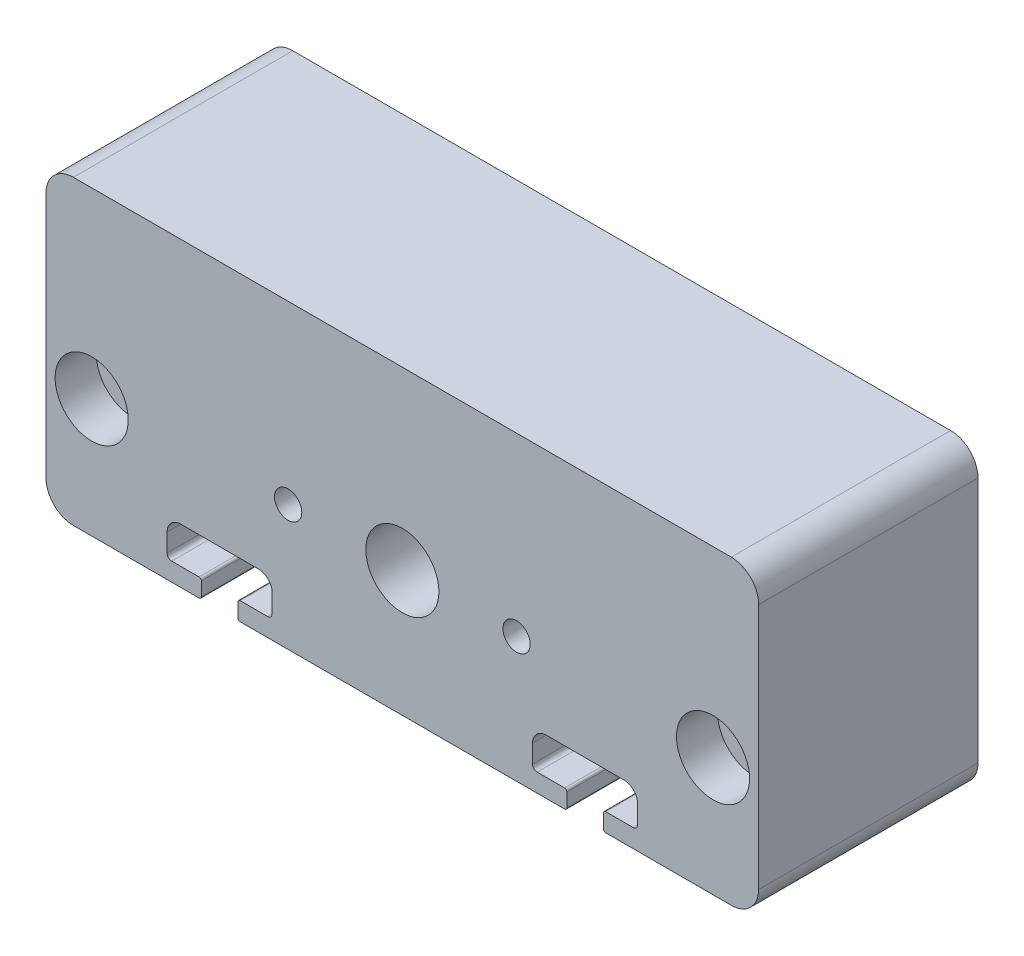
ISO-10303-21;
HEADER;
FILE_DESCRIPTION(('STEP AP214'),'2;1');
FILE_NAME('part.step','',(''),(''),'','','');
FILE_SCHEMA(('AUTOMOTIVE_DESIGN { 1 0 10303 214 1 1 1 1 }'));
ENDSEC;
DATA;
#1=APPLICATION_CONTEXT('core data for automotive mechanical design processes');
#2=APPLICATION_PROTOCOL_DEFINITION('international standard','automotive_design',2000,#1);
#3=PRODUCT_CONTEXT('',#1,'mechanical');
#4=PRODUCT('Part','Part','',(#3));
#5=PRODUCT_RELATED_PRODUCT_CATEGORY('part','',(#4));
#6=PRODUCT_DEFINITION_FORMATION('','',#4);
#7=PRODUCT_DEFINITION_CONTEXT('part definition',#1,'design');
#8=PRODUCT_DEFINITION('design','',#6,#7);
#9=PRODUCT_DEFINITION_SHAPE('','',#8);
#10=(LENGTH_UNIT() NAMED_UNIT(*) SI_UNIT(.MILLI.,.METRE.));
#11=(NAMED_UNIT(*) PLANE_ANGLE_UNIT() SI_UNIT($,.RADIAN.));
#12=(NAMED_UNIT(*) SI_UNIT($,.STERADIAN.) SOLID_ANGLE_UNIT());
#13=UNCERTAINTY_MEASURE_WITH_UNIT(LENGTH_MEASURE(1.E-05),#10,'distance_accuracy_value','');
#14=(GEOMETRIC_REPRESENTATION_CONTEXT(3) GLOBAL_UNCERTAINTY_ASSIGNED_CONTEXT((#13)) GLOBAL_UNIT_ASSIGNED_CONTEXT((#10,
#11,#12)) REPRESENTATION_CONTEXT('',''));
#15=CARTESIAN_POINT('',(0.,0.,0.));
#16=DIRECTION('',(0.,0.,1.));
#17=DIRECTION('',(1.,0.,0.));
#18=AXIS2_PLACEMENT_3D('',#15,#16,#17);
#19=CARTESIAN_POINT('',(16.0456526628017,-12.2069568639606,102.));
#20=DIRECTION('',(0.,0.,-1.));
#21=DIRECTION('',(-1.,0.,0.));
#22=AXIS2_PLACEMENT_3D('',#19,#20,#21);
#23=CYLINDRICAL_SURFACE('',#22,1.5);
#24=CARTESIAN_POINT('',(16.0456526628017,-12.2069568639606,78.0000000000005));
#25=DIRECTION('',(0.,0.,-1.));
#26=DIRECTION('',(1.,0.,0.));
#27=AXIS2_PLACEMENT_3D('',#24,#25,#26);
#28=CIRCLE('',#27,1.5);
#29=CARTESIAN_POINT('',(14.5456526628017,-12.2069568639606,78.0000000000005));
#30=VERTEX_POINT('',#29);
#31=CARTESIAN_POINT('',(16.0456526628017,-10.7069568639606,78.0000000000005));
#32=VERTEX_POINT('',#31);
#33=EDGE_CURVE('E343',#30,#32,#28,.T.);
#34=ORIENTED_EDGE('',*,*,#33,.T.);
#35=DIRECTION('',(0.,0.,-1.));
#36=VECTOR('',#35,1.);
#37=CARTESIAN_POINT('',(16.0456526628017,-10.7069568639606,102.));
#38=LINE('',#37,#36);
#39=CARTESIAN_POINT('',(16.0456526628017,-10.7069568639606,102.));
#40=VERTEX_POINT('',#39);
#41=EDGE_CURVE('E324',#40,#32,#38,.T.);
#42=ORIENTED_EDGE('',*,*,#41,.F.);
#43=CARTESIAN_POINT('',(16.0456526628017,-12.2069568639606,102.));
#44=DIRECTION('',(0.,0.,-1.));
#45=DIRECTION('',(1.,0.,0.));
#46=AXIS2_PLACEMENT_3D('',#43,#44,#45);
#47=CIRCLE('',#46,1.5);
#48=CARTESIAN_POINT('',(14.5456526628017,-12.2069568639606,102.));
#49=VERTEX_POINT('',#48);
#50=EDGE_CURVE('E331',#49,#40,#47,.T.);
#51=ORIENTED_EDGE('',*,*,#50,.F.);
#52=DIRECTION('',(0.,0.,-1.));
#53=VECTOR('',#52,1.);
#54=CARTESIAN_POINT('',(14.5456526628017,-12.2069568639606,102.));
#55=LINE('',#54,#53);
#56=EDGE_CURVE('E531',#49,#30,#55,.T.);
#57=ORIENTED_EDGE('',*,*,#56,.T.);
#58=EDGE_LOOP('',(#34,#42,#51,#57));
#59=FACE_BOUND('',#58,.T.);
#60=ADVANCED_FACE('F16',(#59),#23,.F.);
#61=CARTESIAN_POINT('',(16.0456526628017,-10.7069568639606,102.));
#62=DIRECTION('',(0.,1.,0.));
#63=DIRECTION('',(0.,0.,1.));
#64=AXIS2_PLACEMENT_3D('',#61,#62,#63);
#65=PLANE('',#64);
#66=DIRECTION('',(1.,0.,0.));
#67=VECTOR('',#66,1.);
#68=CARTESIAN_POINT('',(16.0456526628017,-10.7069568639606,78.0000000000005));
#69=LINE('',#68,#67);
#70=CARTESIAN_POINT('',(24.5456526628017,-10.7069568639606,78.0000000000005));
#71=VERTEX_POINT('',#70);
#72=EDGE_CURVE('E533',#32,#71,#69,.T.);
#73=ORIENTED_EDGE('',*,*,#72,.T.);
#74=DIRECTION('',(0.,0.,-1.));
#75=VECTOR('',#74,1.);
#76=CARTESIAN_POINT('',(24.5456526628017,-10.7069568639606,102.));
#77=LINE('',#76,#75);
#78=CARTESIAN_POINT('',(24.5456526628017,-10.7069568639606,102.));
#79=VERTEX_POINT('',#78);
#80=EDGE_CURVE('E327',#79,#71,#77,.T.);
#81=ORIENTED_EDGE('',*,*,#80,.F.);
#82=DIRECTION('',(1.,0.,0.));
#83=VECTOR('',#82,1.);
#84=CARTESIAN_POINT('',(16.0456526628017,-10.7069568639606,102.));
#85=LINE('',#84,#83);
#86=EDGE_CURVE('E320',#40,#79,#85,.T.);
#87=ORIENTED_EDGE('',*,*,#86,.F.);
#88=ORIENTED_EDGE('',*,*,#41,.T.);
#89=EDGE_LOOP('',(#73,#81,#87,#88));
#90=FACE_BOUND('',#89,.T.);
#91=ADVANCED_FACE('F322',(#90),#65,.F.);
#92=CARTESIAN_POINT('',(24.5456526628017,-12.2069568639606,102.));
#93=DIRECTION('',(0.,0.,-1.));
#94=DIRECTION('',(-1.,0.,0.));
#95=AXIS2_PLACEMENT_3D('',#92,#93,#94);
#96=CYLINDRICAL_SURFACE('',#95,1.5);
#97=CARTESIAN_POINT('',(24.5456526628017,-12.2069568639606,78.0000000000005));
#98=DIRECTION('',(0.,0.,-1.));
#99=DIRECTION('',(1.,0.,0.));
#100=AXIS2_PLACEMENT_3D('',#97,#98,#99);
#101=CIRCLE('',#100,1.5);
#102=CARTESIAN_POINT('',(26.0456526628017,-12.2069568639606,78.0000000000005));
#103=VERTEX_POINT('',#102);
#104=EDGE_CURVE('E535',#71,#103,#101,.T.);
#105=ORIENTED_EDGE('',*,*,#104,.T.);
#106=DIRECTION('',(0.,0.,-1.));
#107=VECTOR('',#106,1.);
#108=CARTESIAN_POINT('',(26.0456526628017,-12.2069568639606,102.));
#109=LINE('',#108,#107);
#110=CARTESIAN_POINT('',(26.0456526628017,-12.2069568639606,102.));
#111=VERTEX_POINT('',#110);
#112=EDGE_CURVE('E348',#111,#103,#109,.T.);
#113=ORIENTED_EDGE('',*,*,#112,.F.);
#114=CARTESIAN_POINT('',(24.5456526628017,-12.2069568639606,102.));
#115=DIRECTION('',(0.,0.,-1.));
#116=DIRECTION('',(1.,0.,0.));
#117=AXIS2_PLACEMENT_3D('',#114,#115,#116);
#118=CIRCLE('',#117,1.5);
#119=EDGE_CURVE('E330',#79,#111,#118,.T.);
#120=ORIENTED_EDGE('',*,*,#119,.F.);
#121=ORIENTED_EDGE('',*,*,#80,.T.);
#122=EDGE_LOOP('',(#105,#113,#120,#121));
#123=FACE_BOUND('',#122,.T.);
#124=ADVANCED_FACE('F741',(#123),#96,.F.);
#125=CARTESIAN_POINT('',(26.0456526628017,-12.2069568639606,102.));
#126=DIRECTION('',(1.,0.,0.));
#127=DIRECTION('',(0.,0.,-1.));
#128=AXIS2_PLACEMENT_3D('',#125,#126,#127);
#129=PLANE('',#128);
#130=DIRECTION('',(0.,-1.,0.));
#131=VECTOR('',#130,1.);
#132=CARTESIAN_POINT('',(26.0456526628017,-12.2069568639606,78.0000000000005));
#133=LINE('',#132,#131);
#134=CARTESIAN_POINT('',(26.0456526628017,-14.2069568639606,78.0000000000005));
#135=VERTEX_POINT('',#134);
#136=EDGE_CURVE('E537',#103,#135,#133,.T.);
#137=ORIENTED_EDGE('',*,*,#136,.T.);
#138=DIRECTION('',(0.,0.,-1.));
#139=VECTOR('',#138,1.);
#140=CARTESIAN_POINT('',(26.0456526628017,-14.2069568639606,102.));
#141=LINE('',#140,#139);
#142=CARTESIAN_POINT('',(26.0456526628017,-14.2069568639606,102.));
#143=VERTEX_POINT('',#142);
#144=EDGE_CURVE('E716',#143,#135,#141,.T.);
#145=ORIENTED_EDGE('',*,*,#144,.F.);
#146=DIRECTION('',(0.,-1.,0.));
#147=VECTOR('',#146,1.);
#148=CARTESIAN_POINT('',(26.0456526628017,-12.2069568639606,102.));
#149=LINE('',#148,#147);
#150=EDGE_CURVE('E458',#111,#143,#149,.T.);
#151=ORIENTED_EDGE('',*,*,#150,.F.);
#152=ORIENTED_EDGE('',*,*,#112,.T.);
#153=EDGE_LOOP('',(#137,#145,#151,#152));
#154=FACE_BOUND('',#153,.T.);
#155=ADVANCED_FACE('F723',(#154),#129,.F.);
#156=CARTESIAN_POINT('',(25.5456526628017,-14.2069568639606,102.));
#157=DIRECTION('',(0.,0.,-1.));
#158=DIRECTION('',(-1.,0.,0.));
#159=AXIS2_PLACEMENT_3D('',#156,#157,#158);
#160=CYLINDRICAL_SURFACE('',#159,0.499999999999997);
#161=CARTESIAN_POINT('',(25.5456526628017,-14.2069568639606,78.0000000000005));
#162=DIRECTION('',(0.,0.,-1.));
#163=DIRECTION('',(1.,0.,0.));
#164=AXIS2_PLACEMENT_3D('',#161,#162,#163);
#165=CIRCLE('',#164,0.499999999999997);
#166=CARTESIAN_POINT('',(25.5456526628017,-14.7069568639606,78.0000000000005));
#167=VERTEX_POINT('',#166);
#168=EDGE_CURVE('E539',#135,#167,#165,.T.);
#169=ORIENTED_EDGE('',*,*,#168,.T.);
#170=DIRECTION('',(0.,0.,-1.));
#171=VECTOR('',#170,1.);
#172=CARTESIAN_POINT('',(25.5456526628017,-14.7069568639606,102.));
#173=LINE('',#172,#171);
#174=CARTESIAN_POINT('',(25.5456526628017,-14.7069568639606,102.));
#175=VERTEX_POINT('',#174);
#176=EDGE_CURVE('E713',#175,#167,#173,.T.);
#177=ORIENTED_EDGE('',*,*,#176,.F.);
#178=CARTESIAN_POINT('',(25.5456526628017,-14.2069568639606,102.));
#179=DIRECTION('',(0.,0.,-1.));
#180=DIRECTION('',(1.,0.,0.));
#181=AXIS2_PLACEMENT_3D('',#178,#179,#180);
#182=CIRCLE('',#181,0.499999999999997);
#183=EDGE_CURVE('E460',#143,#175,#182,.T.);
#184=ORIENTED_EDGE('',*,*,#183,.F.);
#185=ORIENTED_EDGE('',*,*,#144,.T.);
#186=EDGE_LOOP('',(#169,#177,#184,#185));
#187=FACE_BOUND('',#186,.T.);
#188=ADVANCED_FACE('F733',(#187),#160,.F.);
#189=CARTESIAN_POINT('',(25.5456526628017,-14.7069568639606,102.));
#190=DIRECTION('',(0.,-1.,0.));
#191=DIRECTION('',(0.,0.,-1.));
#192=AXIS2_PLACEMENT_3D('',#189,#190,#191);
#193=PLANE('',#192);
#194=DIRECTION('',(-1.,0.,0.));
#195=VECTOR('',#194,1.);
#196=CARTESIAN_POINT('',(25.5456526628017,-14.7069568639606,78.0000000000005));
#197=LINE('',#196,#195);
#198=CARTESIAN_POINT('',(22.5456526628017,-14.7069568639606,78.0000000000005));
#199=VERTEX_POINT('',#198);
#200=EDGE_CURVE('E541',#167,#199,#197,.T.);
#201=ORIENTED_EDGE('',*,*,#200,.T.);
#202=DIRECTION('',(0.,0.,-1.));
#203=VECTOR('',#202,1.);
#204=CARTESIAN_POINT('',(22.5456526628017,-14.7069568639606,102.));
#205=LINE('',#204,#203);
#206=CARTESIAN_POINT('',(22.5456526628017,-14.7069568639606,102.));
#207=VERTEX_POINT('',#206);
#208=EDGE_CURVE('E710',#207,#199,#205,.T.);
#209=ORIENTED_EDGE('',*,*,#208,.F.);
#210=DIRECTION('',(-1.,0.,0.));
#211=VECTOR('',#210,1.);
#212=CARTESIAN_POINT('',(25.5456526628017,-14.7069568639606,102.));
#213=LINE('',#212,#211);
#214=EDGE_CURVE('E462',#175,#207,#213,.T.);
#215=ORIENTED_EDGE('',*,*,#214,.F.);
#216=ORIENTED_EDGE('',*,*,#176,.T.);
#217=EDGE_LOOP('',(#201,#209,#215,#216));
#218=FACE_BOUND('',#217,.T.);
#219=ADVANCED_FACE('F737',(#218),#193,.F.);
#220=CARTESIAN_POINT('',(22.5456526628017,-14.9569568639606,102.));
#221=DIRECTION('',(0.,0.,-1.));
#222=DIRECTION('',(-1.,0.,0.));
#223=AXIS2_PLACEMENT_3D('',#220,#221,#222);
#224=CYLINDRICAL_SURFACE('',#223,0.25);
#225=CARTESIAN_POINT('',(22.5456526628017,-14.9569568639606,78.0000000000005));
#226=DIRECTION('',(0.,0.,1.));
#227=DIRECTION('',(1.,0.,0.));
#228=AXIS2_PLACEMENT_3D('',#225,#226,#227);
#229=CIRCLE('',#228,0.25);
#230=CARTESIAN_POINT('',(22.2956526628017,-14.9569568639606,78.0000000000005));
#231=VERTEX_POINT('',#230);
#232=EDGE_CURVE('E543',#199,#231,#229,.T.);
#233=ORIENTED_EDGE('',*,*,#232,.T.);
#234=DIRECTION('',(0.,0.,-1.));
#235=VECTOR('',#234,1.);
#236=CARTESIAN_POINT('',(22.2956526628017,-14.9569568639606,102.));
#237=LINE('',#236,#235);
#238=CARTESIAN_POINT('',(22.2956526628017,-14.9569568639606,102.));
#239=VERTEX_POINT('',#238);
#240=EDGE_CURVE('E707',#239,#231,#237,.T.);
#241=ORIENTED_EDGE('',*,*,#240,.F.);
#242=CARTESIAN_POINT('',(22.5456526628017,-14.9569568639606,102.));
#243=DIRECTION('',(0.,0.,1.));
#244=DIRECTION('',(1.,0.,0.));
#245=AXIS2_PLACEMENT_3D('',#242,#243,#244);
#246=CIRCLE('',#245,0.25);
#247=EDGE_CURVE('E464',#207,#239,#246,.T.);
#248=ORIENTED_EDGE('',*,*,#247,.F.);
#249=ORIENTED_EDGE('',*,*,#208,.T.);
#250=EDGE_LOOP('',(#233,#241,#248,#249));
#251=FACE_BOUND('',#250,.T.);
#252=ADVANCED_FACE('F946',(#251),#224,.T.);
#253=CARTESIAN_POINT('',(22.2956526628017,-14.9569568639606,102.));
#254=DIRECTION('',(1.,0.,0.));
#255=DIRECTION('',(0.,0.,-1.));
#256=AXIS2_PLACEMENT_3D('',#253,#254,#255);
#257=PLANE('',#256);
#258=DIRECTION('',(0.,-1.,0.));
#259=VECTOR('',#258,1.);
#260=CARTESIAN_POINT('',(22.2956526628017,-14.9569568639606,78.0000000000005));
#261=LINE('',#260,#259);
#262=CARTESIAN_POINT('',(22.2956526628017,-16.4569568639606,78.0000000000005));
#263=VERTEX_POINT('',#262);
#264=EDGE_CURVE('E545',#231,#263,#261,.T.);
#265=ORIENTED_EDGE('',*,*,#264,.T.);
#266=DIRECTION('',(0.,0.,-1.));
#267=VECTOR('',#266,1.);
#268=CARTESIAN_POINT('',(22.2956526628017,-16.4569568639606,102.));
#269=LINE('',#268,#267);
#270=CARTESIAN_POINT('',(22.2956526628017,-16.4569568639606,102.));
#271=VERTEX_POINT('',#270);
#272=EDGE_CURVE('E704',#271,#263,#269,.T.);
#273=ORIENTED_EDGE('',*,*,#272,.F.);
#274=DIRECTION('',(0.,-1.,0.));
#275=VECTOR('',#274,1.);
#276=CARTESIAN_POINT('',(22.2956526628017,-14.9569568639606,102.));
#277=LINE('',#276,#275);
#278=EDGE_CURVE('E466',#239,#271,#277,.T.);
#279=ORIENTED_EDGE('',*,*,#278,.F.);
#280=ORIENTED_EDGE('',*,*,#240,.T.);
#281=EDGE_LOOP('',(#265,#273,#279,#280));
#282=FACE_BOUND('',#281,.T.);
#283=ADVANCED_FACE('F942',(#282),#257,.F.);
#284=CARTESIAN_POINT('',(22.5456526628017,-16.4569568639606,102.));
#285=DIRECTION('',(0.,0.,-1.));
#286=DIRECTION('',(-1.,0.,0.));
#287=AXIS2_PLACEMENT_3D('',#284,#285,#286);
#288=CYLINDRICAL_SURFACE('',#287,0.25);
#289=CARTESIAN_POINT('',(22.5456526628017,-16.4569568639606,78.0000000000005));
#290=DIRECTION('',(0.,0.,1.));
#291=DIRECTION('',(1.,0.,0.));
#292=AXIS2_PLACEMENT_3D('',#289,#290,#291);
#293=CIRCLE('',#292,0.25);
#294=CARTESIAN_POINT('',(22.5456526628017,-16.7069568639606,78.0000000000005));
#295=VERTEX_POINT('',#294);
#296=EDGE_CURVE('E547',#263,#295,#293,.T.);
#297=ORIENTED_EDGE('',*,*,#296,.T.);
#298=DIRECTION('',(0.,0.,-1.));
#299=VECTOR('',#298,1.);
#300=CARTESIAN_POINT('',(22.5456526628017,-16.7069568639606,102.));
#301=LINE('',#300,#299);
#302=CARTESIAN_POINT('',(22.5456526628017,-16.7069568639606,102.));
#303=VERTEX_POINT('',#302);
#304=EDGE_CURVE('E701',#303,#295,#301,.T.);
#305=ORIENTED_EDGE('',*,*,#304,.F.);
#306=CARTESIAN_POINT('',(22.5456526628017,-16.4569568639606,102.));
#307=DIRECTION('',(0.,0.,1.));
#308=DIRECTION('',(1.,0.,0.));
#309=AXIS2_PLACEMENT_3D('',#306,#307,#308);
#310=CIRCLE('',#309,0.25);
#311=EDGE_CURVE('E468',#271,#303,#310,.T.);
#312=ORIENTED_EDGE('',*,*,#311,.F.);
#313=ORIENTED_EDGE('',*,*,#272,.T.);
#314=EDGE_LOOP('',(#297,#305,#312,#313));
#315=FACE_BOUND('',#314,.T.);
#316=ADVANCED_FACE('F938',(#315),#288,.T.);
#317=CARTESIAN_POINT('',(22.5456526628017,-16.7069568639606,102.));
#318=DIRECTION('',(0.,1.,0.));
#319=DIRECTION('',(-1.,0.,0.));
#320=AXIS2_PLACEMENT_3D('',#317,#318,#319);
#321=PLANE('',#320);
#322=DIRECTION('',(1.,0.,0.));
#323=VECTOR('',#322,1.);
#324=CARTESIAN_POINT('',(22.5456526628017,-16.7069568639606,78.0000000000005));
#325=LINE('',#324,#323);
#326=CARTESIAN_POINT('',(36.2956526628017,-16.7069568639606,78.0000000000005));
#327=VERTEX_POINT('',#326);
#328=EDGE_CURVE('E549',#295,#327,#325,.T.);
#329=ORIENTED_EDGE('',*,*,#328,.T.);
#330=DIRECTION('',(0.,0.,-1.));
#331=VECTOR('',#330,1.);
#332=CARTESIAN_POINT('',(36.2956526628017,-16.7069568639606,102.));
#333=LINE('',#332,#331);
#334=CARTESIAN_POINT('',(36.2956526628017,-16.7069568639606,102.));
#335=VERTEX_POINT('',#334);
#336=EDGE_CURVE('E698',#335,#327,#333,.T.);
#337=ORIENTED_EDGE('',*,*,#336,.F.);
#338=DIRECTION('',(1.,0.,0.));
#339=VECTOR('',#338,1.);
#340=CARTESIAN_POINT('',(22.5456526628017,-16.7069568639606,102.));
#341=LINE('',#340,#339);
#342=EDGE_CURVE('E470',#303,#335,#341,.T.);
#343=ORIENTED_EDGE('',*,*,#342,.F.);
#344=ORIENTED_EDGE('',*,*,#304,.T.);
#345=EDGE_LOOP('',(#329,#337,#343,#344));
#346=FACE_BOUND('',#345,.T.);
#347=ADVANCED_FACE('F934',(#346),#321,.F.);
#348=CARTESIAN_POINT('',(36.2956526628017,-13.7069568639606,102.));
#349=DIRECTION('',(0.,0.,-1.));
#350=DIRECTION('',(-1.,0.,0.));
#351=AXIS2_PLACEMENT_3D('',#348,#349,#350);
#352=CYLINDRICAL_SURFACE('',#351,3.);
#353=CARTESIAN_POINT('',(36.2956526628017,-13.7069568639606,78.0000000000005));
#354=DIRECTION('',(0.,0.,1.));
#355=DIRECTION('',(1.,0.,0.));
#356=AXIS2_PLACEMENT_3D('',#353,#354,#355);
#357=CIRCLE('',#356,3.);
#358=CARTESIAN_POINT('',(39.2956526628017,-13.7069568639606,78.0000000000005));
#359=VERTEX_POINT('',#358);
#360=EDGE_CURVE('E551',#327,#359,#357,.T.);
#361=ORIENTED_EDGE('',*,*,#360,.T.);
#362=DIRECTION('',(0.,0.,-1.));
#363=VECTOR('',#362,1.);
#364=CARTESIAN_POINT('',(39.2956526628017,-13.7069568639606,102.));
#365=LINE('',#364,#363);
#366=CARTESIAN_POINT('',(39.2956526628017,-13.7069568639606,102.));
#367=VERTEX_POINT('',#366);
#368=EDGE_CURVE('E695',#367,#359,#365,.T.);
#369=ORIENTED_EDGE('',*,*,#368,.F.);
#370=CARTESIAN_POINT('',(36.2956526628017,-13.7069568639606,102.));
#371=DIRECTION('',(0.,0.,1.));
#372=DIRECTION('',(1.,0.,0.));
#373=AXIS2_PLACEMENT_3D('',#370,#371,#372);
#374=CIRCLE('',#373,3.);
#375=EDGE_CURVE('E472',#335,#367,#374,.T.);
#376=ORIENTED_EDGE('',*,*,#375,.F.);
#377=ORIENTED_EDGE('',*,*,#336,.T.);
#378=EDGE_LOOP('',(#361,#369,#376,#377));
#379=FACE_BOUND('',#378,.T.);
#380=ADVANCED_FACE('F930',(#379),#352,.T.);
#381=CARTESIAN_POINT('',(39.2956526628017,-13.7069568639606,102.));
#382=DIRECTION('',(-1.,0.,0.));
#383=DIRECTION('',(0.,0.,1.));
#384=AXIS2_PLACEMENT_3D('',#381,#382,#383);
#385=PLANE('',#384);
#386=DIRECTION('',(0.,1.,0.));
#387=VECTOR('',#386,1.);
#388=CARTESIAN_POINT('',(39.2956526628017,-13.7069568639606,78.0000000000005));
#389=LINE('',#388,#387);
#390=CARTESIAN_POINT('',(39.2956526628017,13.2930431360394,78.0000000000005));
#391=VERTEX_POINT('',#390);
#392=EDGE_CURVE('E553',#359,#391,#389,.T.);
#393=ORIENTED_EDGE('',*,*,#392,.T.);
#394=DIRECTION('',(0.,0.,-1.));
#395=VECTOR('',#394,1.);
#396=CARTESIAN_POINT('',(39.2956526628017,13.2930431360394,102.));
#397=LINE('',#396,#395);
#398=CARTESIAN_POINT('',(39.2956526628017,13.2930431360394,102.));
#399=VERTEX_POINT('',#398);
#400=EDGE_CURVE('E692',#399,#391,#397,.T.);
#401=ORIENTED_EDGE('',*,*,#400,.F.);
#402=DIRECTION('',(0.,1.,0.));
#403=VECTOR('',#402,1.);
#404=CARTESIAN_POINT('',(39.2956526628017,-13.7069568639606,102.));
#405=LINE('',#404,#403);
#406=EDGE_CURVE('E474',#367,#399,#405,.T.);
#407=ORIENTED_EDGE('',*,*,#406,.F.);
#408=ORIENTED_EDGE('',*,*,#368,.T.);
#409=EDGE_LOOP('',(#393,#401,#407,#408));
#410=FACE_BOUND('',#409,.T.);
#411=ADVANCED_FACE('F926',(#410),#385,.F.);
#412=CARTESIAN_POINT('',(36.2956526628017,13.2930431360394,102.));
#413=DIRECTION('',(0.,0.,-1.));
#414=DIRECTION('',(-1.,0.,0.));
#415=AXIS2_PLACEMENT_3D('',#412,#413,#414);
#416=CYLINDRICAL_SURFACE('',#415,3.);
#417=CARTESIAN_POINT('',(36.2956526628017,13.2930431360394,78.0000000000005));
#418=DIRECTION('',(0.,0.,1.));
#419=DIRECTION('',(1.,0.,0.));
#420=AXIS2_PLACEMENT_3D('',#417,#418,#419);
#421=CIRCLE('',#420,3.);
#422=CARTESIAN_POINT('',(36.2956526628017,16.2930431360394,78.0000000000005));
#423=VERTEX_POINT('',#422);
#424=EDGE_CURVE('E555',#391,#423,#421,.T.);
#425=ORIENTED_EDGE('',*,*,#424,.T.);
#426=DIRECTION('',(0.,0.,-1.));
#427=VECTOR('',#426,1.);
#428=CARTESIAN_POINT('',(36.2956526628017,16.2930431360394,102.));
#429=LINE('',#428,#427);
#430=CARTESIAN_POINT('',(36.2956526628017,16.2930431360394,102.));
#431=VERTEX_POINT('',#430);
#432=EDGE_CURVE('E689',#431,#423,#429,.T.);
#433=ORIENTED_EDGE('',*,*,#432,.F.);
#434=CARTESIAN_POINT('',(36.2956526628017,13.2930431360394,102.));
#435=DIRECTION('',(0.,0.,1.));
#436=DIRECTION('',(1.,0.,0.));
#437=AXIS2_PLACEMENT_3D('',#434,#435,#436);
#438=CIRCLE('',#437,3.);
#439=EDGE_CURVE('E476',#399,#431,#438,.T.);
#440=ORIENTED_EDGE('',*,*,#439,.F.);
#441=ORIENTED_EDGE('',*,*,#400,.T.);
#442=EDGE_LOOP('',(#425,#433,#440,#441));
#443=FACE_BOUND('',#442,.T.);
#444=ADVANCED_FACE('F922',(#443),#416,.T.);
#445=CARTESIAN_POINT('',(36.2956526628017,16.2930431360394,102.));
#446=DIRECTION('',(0.,-1.,0.));
#447=DIRECTION('',(0.,0.,-1.));
#448=AXIS2_PLACEMENT_3D('',#445,#446,#447);
#449=PLANE('',#448);
#450=DIRECTION('',(-1.,0.,0.));
#451=VECTOR('',#450,1.);
#452=CARTESIAN_POINT('',(36.2956526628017,16.2930431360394,78.0000000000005));
#453=LINE('',#452,#451);
#454=CARTESIAN_POINT('',(-35.7043473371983,16.2930431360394,78.0000000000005));
#455=VERTEX_POINT('',#454);
#456=EDGE_CURVE('E557',#423,#455,#453,.T.);
#457=ORIENTED_EDGE('',*,*,#456,.T.);
#458=DIRECTION('',(0.,0.,-1.));
#459=VECTOR('',#458,1.);
#460=CARTESIAN_POINT('',(-35.7043473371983,16.2930431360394,102.));
#461=LINE('',#460,#459);
#462=CARTESIAN_POINT('',(-35.7043473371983,16.2930431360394,102.));
#463=VERTEX_POINT('',#462);
#464=EDGE_CURVE('E686',#463,#455,#461,.T.);
#465=ORIENTED_EDGE('',*,*,#464,.F.);
#466=DIRECTION('',(-1.,0.,0.));
#467=VECTOR('',#466,1.);
#468=CARTESIAN_POINT('',(36.2956526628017,16.2930431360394,102.));
#469=LINE('',#468,#467);
#470=EDGE_CURVE('E478',#431,#463,#469,.T.);
#471=ORIENTED_EDGE('',*,*,#470,.F.);
#472=ORIENTED_EDGE('',*,*,#432,.T.);
#473=EDGE_LOOP('',(#457,#465,#471,#472));
#474=FACE_BOUND('',#473,.T.);
#475=ADVANCED_FACE('F918',(#474),#449,.F.);
#476=CARTESIAN_POINT('',(-35.7043473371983,13.2930431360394,102.));
#477=DIRECTION('',(0.,0.,-1.));
#478=DIRECTION('',(-1.,0.,0.));
#479=AXIS2_PLACEMENT_3D('',#476,#477,#478);
#480=CYLINDRICAL_SURFACE('',#479,3.);
#481=CARTESIAN_POINT('',(-35.7043473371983,13.2930431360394,78.0000000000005));
#482=DIRECTION('',(0.,0.,1.));
#483=DIRECTION('',(-1.,0.,0.));
#484=AXIS2_PLACEMENT_3D('',#481,#482,#483);
#485=CIRCLE('',#484,3.);
#486=CARTESIAN_POINT('',(-38.7043473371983,13.2930431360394,78.0000000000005));
#487=VERTEX_POINT('',#486);
#488=EDGE_CURVE('E559',#455,#487,#485,.T.);
#489=ORIENTED_EDGE('',*,*,#488,.T.);
#490=DIRECTION('',(0.,0.,-1.));
#491=VECTOR('',#490,1.);
#492=CARTESIAN_POINT('',(-38.7043473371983,13.2930431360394,102.));
#493=LINE('',#492,#491);
#494=CARTESIAN_POINT('',(-38.7043473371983,13.2930431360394,102.));
#495=VERTEX_POINT('',#494);
#496=EDGE_CURVE('E683',#495,#487,#493,.T.);
#497=ORIENTED_EDGE('',*,*,#496,.F.);
#498=CARTESIAN_POINT('',(-35.7043473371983,13.2930431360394,102.));
#499=DIRECTION('',(0.,0.,1.));
#500=DIRECTION('',(-1.,0.,0.));
#501=AXIS2_PLACEMENT_3D('',#498,#499,#500);
#502=CIRCLE('',#501,3.);
#503=EDGE_CURVE('E480',#463,#495,#502,.T.);
#504=ORIENTED_EDGE('',*,*,#503,.F.);
#505=ORIENTED_EDGE('',*,*,#464,.T.);
#506=EDGE_LOOP('',(#489,#497,#504,#505));
#507=FACE_BOUND('',#506,.T.);
#508=ADVANCED_FACE('F914',(#507),#480,.T.);
#509=CARTESIAN_POINT('',(-38.7043473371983,-13.7069568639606,102.));
#510=DIRECTION('',(1.,0.,0.));
#511=DIRECTION('',(0.,0.,-1.));
#512=AXIS2_PLACEMENT_3D('',#509,#510,#511);
#513=PLANE('',#512);
#514=DIRECTION('',(0.,-1.,0.));
#515=VECTOR('',#514,1.);
#516=CARTESIAN_POINT('',(-38.7043473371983,-13.7069568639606,78.0000000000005));
#517=LINE('',#516,#515);
#518=CARTESIAN_POINT('',(-38.7043473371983,-13.7069568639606,78.0000000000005));
#519=VERTEX_POINT('',#518);
#520=EDGE_CURVE('E561',#487,#519,#517,.T.);
#521=ORIENTED_EDGE('',*,*,#520,.T.);
#522=DIRECTION('',(0.,0.,-1.));
#523=VECTOR('',#522,1.);
#524=CARTESIAN_POINT('',(-38.7043473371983,-13.7069568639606,102.));
#525=LINE('',#524,#523);
#526=CARTESIAN_POINT('',(-38.7043473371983,-13.7069568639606,102.));
#527=VERTEX_POINT('',#526);
#528=EDGE_CURVE('E680',#527,#519,#525,.T.);
#529=ORIENTED_EDGE('',*,*,#528,.F.);
#530=DIRECTION('',(0.,-1.,0.));
#531=VECTOR('',#530,1.);
#532=CARTESIAN_POINT('',(-38.7043473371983,-13.7069568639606,102.));
#533=LINE('',#532,#531);
#534=EDGE_CURVE('E482',#495,#527,#533,.T.);
#535=ORIENTED_EDGE('',*,*,#534,.F.);
#536=ORIENTED_EDGE('',*,*,#496,.T.);
#537=EDGE_LOOP('',(#521,#529,#535,#536));
#538=FACE_BOUND('',#537,.T.);
#539=ADVANCED_FACE('F910',(#538),#513,.F.);
#540=CARTESIAN_POINT('',(-35.7043473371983,-13.7069568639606,102.));
#541=DIRECTION('',(0.,0.,-1.));
#542=DIRECTION('',(-1.,0.,0.));
#543=AXIS2_PLACEMENT_3D('',#540,#541,#542);
#544=CYLINDRICAL_SURFACE('',#543,3.);
#545=CARTESIAN_POINT('',(-35.7043473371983,-13.7069568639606,78.0000000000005));
#546=DIRECTION('',(0.,0.,1.));
#547=DIRECTION('',(-1.,0.,0.));
#548=AXIS2_PLACEMENT_3D('',#545,#546,#547);
#549=CIRCLE('',#548,3.);
#550=CARTESIAN_POINT('',(-35.7043473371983,-16.7069568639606,78.0000000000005));
#551=VERTEX_POINT('',#550);
#552=EDGE_CURVE('E563',#519,#551,#549,.T.);
#553=ORIENTED_EDGE('',*,*,#552,.T.);
#554=DIRECTION('',(0.,0.,-1.));
#555=VECTOR('',#554,1.);
#556=CARTESIAN_POINT('',(-35.7043473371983,-16.7069568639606,102.));
#557=LINE('',#556,#555);
#558=CARTESIAN_POINT('',(-35.7043473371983,-16.7069568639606,102.));
#559=VERTEX_POINT('',#558);
#560=EDGE_CURVE('E677',#559,#551,#557,.T.);
#561=ORIENTED_EDGE('',*,*,#560,.F.);
#562=CARTESIAN_POINT('',(-35.7043473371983,-13.7069568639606,102.));
#563=DIRECTION('',(0.,0.,1.));
#564=DIRECTION('',(-1.,0.,0.));
#565=AXIS2_PLACEMENT_3D('',#562,#563,#564);
#566=CIRCLE('',#565,3.);
#567=EDGE_CURVE('E484',#527,#559,#566,.T.);
#568=ORIENTED_EDGE('',*,*,#567,.F.);
#569=ORIENTED_EDGE('',*,*,#528,.T.);
#570=EDGE_LOOP('',(#553,#561,#568,#569));
#571=FACE_BOUND('',#570,.T.);
#572=ADVANCED_FACE('F906',(#571),#544,.T.);
#573=CARTESIAN_POINT('',(-21.9543473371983,-16.7069568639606,102.));
#574=DIRECTION('',(0.,1.,0.));
#575=DIRECTION('',(-1.,0.,0.));
#576=AXIS2_PLACEMENT_3D('',#573,#574,#575);
#577=PLANE('',#576);
#578=DIRECTION('',(1.,0.,0.));
#579=VECTOR('',#578,1.);
#580=CARTESIAN_POINT('',(-21.9543473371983,-16.7069568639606,78.0000000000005));
#581=LINE('',#580,#579);
#582=CARTESIAN_POINT('',(-21.9543473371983,-16.7069568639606,78.0000000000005));
#583=VERTEX_POINT('',#582);
#584=EDGE_CURVE('E565',#551,#583,#581,.T.);
#585=ORIENTED_EDGE('',*,*,#584,.T.);
#586=DIRECTION('',(0.,0.,-1.));
#587=VECTOR('',#586,1.);
#588=CARTESIAN_POINT('',(-21.9543473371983,-16.7069568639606,102.));
#589=LINE('',#588,#587);
#590=CARTESIAN_POINT('',(-21.9543473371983,-16.7069568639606,102.));
#591=VERTEX_POINT('',#590);
#592=EDGE_CURVE('E674',#591,#583,#589,.T.);
#593=ORIENTED_EDGE('',*,*,#592,.F.);
#594=DIRECTION('',(1.,0.,0.));
#595=VECTOR('',#594,1.);
#596=CARTESIAN_POINT('',(-21.9543473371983,-16.7069568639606,102.));
#597=LINE('',#596,#595);
#598=EDGE_CURVE('E486',#559,#591,#597,.T.);
#599=ORIENTED_EDGE('',*,*,#598,.F.);
#600=ORIENTED_EDGE('',*,*,#560,.T.);
#601=EDGE_LOOP('',(#585,#593,#599,#600));
#602=FACE_BOUND('',#601,.T.);
#603=ADVANCED_FACE('F902',(#602),#577,.F.);
#604=CARTESIAN_POINT('',(-21.9543473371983,-16.4569568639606,102.));
#605=DIRECTION('',(0.,0.,-1.));
#606=DIRECTION('',(-1.,0.,0.));
#607=AXIS2_PLACEMENT_3D('',#604,#605,#606);
#608=CYLINDRICAL_SURFACE('',#607,0.25);
#609=CARTESIAN_POINT('',(-21.9543473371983,-16.4569568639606,78.0000000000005));
#610=DIRECTION('',(0.,0.,1.));
#611=DIRECTION('',(-1.,0.,0.));
#612=AXIS2_PLACEMENT_3D('',#609,#610,#611);
#613=CIRCLE('',#612,0.25);
#614=CARTESIAN_POINT('',(-21.7043473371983,-16.4569568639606,78.0000000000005));
#615=VERTEX_POINT('',#614);
#616=EDGE_CURVE('E567',#583,#615,#613,.T.);
#617=ORIENTED_EDGE('',*,*,#616,.T.);
#618=DIRECTION('',(0.,0.,-1.));
#619=VECTOR('',#618,1.);
#620=CARTESIAN_POINT('',(-21.7043473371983,-16.4569568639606,102.));
#621=LINE('',#620,#619);
#622=CARTESIAN_POINT('',(-21.7043473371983,-16.4569568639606,102.));
#623=VERTEX_POINT('',#622);
#624=EDGE_CURVE('E671',#623,#615,#621,.T.);
#625=ORIENTED_EDGE('',*,*,#624,.F.);
#626=CARTESIAN_POINT('',(-21.9543473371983,-16.4569568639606,102.));
#627=DIRECTION('',(0.,0.,1.));
#628=DIRECTION('',(-1.,0.,0.));
#629=AXIS2_PLACEMENT_3D('',#626,#627,#628);
#630=CIRCLE('',#629,0.25);
#631=EDGE_CURVE('E488',#591,#623,#630,.T.);
#632=ORIENTED_EDGE('',*,*,#631,.F.);
#633=ORIENTED_EDGE('',*,*,#592,.T.);
#634=EDGE_LOOP('',(#617,#625,#632,#633));
#635=FACE_BOUND('',#634,.T.);
#636=ADVANCED_FACE('F898',(#635),#608,.T.);
#637=CARTESIAN_POINT('',(-21.7043473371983,-14.9569568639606,102.));
#638=DIRECTION('',(-1.,0.,0.));
#639=DIRECTION('',(0.,0.,1.));
#640=AXIS2_PLACEMENT_3D('',#637,#638,#639);
#641=PLANE('',#640);
#642=DIRECTION('',(0.,1.,0.));
#643=VECTOR('',#642,1.);
#644=CARTESIAN_POINT('',(-21.7043473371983,-14.9569568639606,78.0000000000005));
#645=LINE('',#644,#643);
#646=CARTESIAN_POINT('',(-21.7043473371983,-14.9569568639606,78.0000000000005));
#647=VERTEX_POINT('',#646);
#648=EDGE_CURVE('E569',#615,#647,#645,.T.);
#649=ORIENTED_EDGE('',*,*,#648,.T.);
#650=DIRECTION('',(0.,0.,-1.));
#651=VECTOR('',#650,1.);
#652=CARTESIAN_POINT('',(-21.7043473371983,-14.9569568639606,102.));
#653=LINE('',#652,#651);
#654=CARTESIAN_POINT('',(-21.7043473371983,-14.9569568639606,102.));
#655=VERTEX_POINT('',#654);
#656=EDGE_CURVE('E668',#655,#647,#653,.T.);
#657=ORIENTED_EDGE('',*,*,#656,.F.);
#658=DIRECTION('',(0.,1.,0.));
#659=VECTOR('',#658,1.);
#660=CARTESIAN_POINT('',(-21.7043473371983,-14.9569568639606,102.));
#661=LINE('',#660,#659);
#662=EDGE_CURVE('E490',#623,#655,#661,.T.);
#663=ORIENTED_EDGE('',*,*,#662,.F.);
#664=ORIENTED_EDGE('',*,*,#624,.T.);
#665=EDGE_LOOP('',(#649,#657,#663,#664));
#666=FACE_BOUND('',#665,.T.);
#667=ADVANCED_FACE('F894',(#666),#641,.F.);
#668=CARTESIAN_POINT('',(-21.9543473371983,-14.9569568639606,102.));
#669=DIRECTION('',(0.,0.,-1.));
#670=DIRECTION('',(-1.,0.,0.));
#671=AXIS2_PLACEMENT_3D('',#668,#669,#670);
#672=CYLINDRICAL_SURFACE('',#671,0.25);
#673=CARTESIAN_POINT('',(-21.9543473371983,-14.9569568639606,78.0000000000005));
#674=DIRECTION('',(0.,0.,1.));
#675=DIRECTION('',(-1.,0.,0.));
#676=AXIS2_PLACEMENT_3D('',#673,#674,#675);
#677=CIRCLE('',#676,0.25);
#678=CARTESIAN_POINT('',(-21.9543473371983,-14.7069568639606,78.0000000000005));
#679=VERTEX_POINT('',#678);
#680=EDGE_CURVE('E571',#647,#679,#677,.T.);
#681=ORIENTED_EDGE('',*,*,#680,.T.);
#682=DIRECTION('',(0.,0.,-1.));
#683=VECTOR('',#682,1.);
#684=CARTESIAN_POINT('',(-21.9543473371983,-14.7069568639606,102.));
#685=LINE('',#684,#683);
#686=CARTESIAN_POINT('',(-21.9543473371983,-14.7069568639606,102.));
#687=VERTEX_POINT('',#686);
#688=EDGE_CURVE('E665',#687,#679,#685,.T.);
#689=ORIENTED_EDGE('',*,*,#688,.F.);
#690=CARTESIAN_POINT('',(-21.9543473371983,-14.9569568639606,102.));
#691=DIRECTION('',(0.,0.,1.));
#692=DIRECTION('',(-1.,0.,0.));
#693=AXIS2_PLACEMENT_3D('',#690,#691,#692);
#694=CIRCLE('',#693,0.25);
#695=EDGE_CURVE('E492',#655,#687,#694,.T.);
#696=ORIENTED_EDGE('',*,*,#695,.F.);
#697=ORIENTED_EDGE('',*,*,#656,.T.);
#698=EDGE_LOOP('',(#681,#689,#696,#697));
#699=FACE_BOUND('',#698,.T.);
#700=ADVANCED_FACE('F890',(#699),#672,.T.);
#701=CARTESIAN_POINT('',(-24.9543473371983,-14.7069568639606,102.));
#702=DIRECTION('',(0.,-1.,0.));
#703=DIRECTION('',(1.,0.,0.));
#704=AXIS2_PLACEMENT_3D('',#701,#702,#703);
#705=PLANE('',#704);
#706=DIRECTION('',(-1.,0.,0.));
#707=VECTOR('',#706,1.);
#708=CARTESIAN_POINT('',(-24.9543473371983,-14.7069568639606,78.0000000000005));
#709=LINE('',#708,#707);
#710=CARTESIAN_POINT('',(-24.9543473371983,-14.7069568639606,78.0000000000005));
#711=VERTEX_POINT('',#710);
#712=EDGE_CURVE('E573',#679,#711,#709,.T.);
#713=ORIENTED_EDGE('',*,*,#712,.T.);
#714=DIRECTION('',(0.,0.,-1.));
#715=VECTOR('',#714,1.);
#716=CARTESIAN_POINT('',(-24.9543473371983,-14.7069568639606,102.));
#717=LINE('',#716,#715);
#718=CARTESIAN_POINT('',(-24.9543473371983,-14.7069568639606,102.));
#719=VERTEX_POINT('',#718);
#720=EDGE_CURVE('E662',#719,#711,#717,.T.);
#721=ORIENTED_EDGE('',*,*,#720,.F.);
#722=DIRECTION('',(-1.,0.,0.));
#723=VECTOR('',#722,1.);
#724=CARTESIAN_POINT('',(-24.9543473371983,-14.7069568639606,102.));
#725=LINE('',#724,#723);
#726=EDGE_CURVE('E494',#687,#719,#725,.T.);
#727=ORIENTED_EDGE('',*,*,#726,.F.);
#728=ORIENTED_EDGE('',*,*,#688,.T.);
#729=EDGE_LOOP('',(#713,#721,#727,#728));
#730=FACE_BOUND('',#729,.T.);
#731=ADVANCED_FACE('F886',(#730),#705,.F.);
#732=CARTESIAN_POINT('',(-24.9543473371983,-14.2069568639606,102.));
#733=DIRECTION('',(0.,0.,-1.));
#734=DIRECTION('',(-1.,0.,0.));
#735=AXIS2_PLACEMENT_3D('',#732,#733,#734);
#736=CYLINDRICAL_SURFACE('',#735,0.499999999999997);
#737=CARTESIAN_POINT('',(-24.9543473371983,-14.2069568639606,78.0000000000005));
#738=DIRECTION('',(0.,0.,-1.));
#739=DIRECTION('',(-1.,0.,0.));
#740=AXIS2_PLACEMENT_3D('',#737,#738,#739);
#741=CIRCLE('',#740,0.499999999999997);
#742=CARTESIAN_POINT('',(-25.4543473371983,-14.2069568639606,78.0000000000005));
#743=VERTEX_POINT('',#742);
#744=EDGE_CURVE('E575',#711,#743,#741,.T.);
#745=ORIENTED_EDGE('',*,*,#744,.T.);
#746=DIRECTION('',(0.,0.,-1.));
#747=VECTOR('',#746,1.);
#748=CARTESIAN_POINT('',(-25.4543473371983,-14.2069568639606,102.));
#749=LINE('',#748,#747);
#750=CARTESIAN_POINT('',(-25.4543473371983,-14.2069568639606,102.));
#751=VERTEX_POINT('',#750);
#752=EDGE_CURVE('E659',#751,#743,#749,.T.);
#753=ORIENTED_EDGE('',*,*,#752,.F.);
#754=CARTESIAN_POINT('',(-24.9543473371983,-14.2069568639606,102.));
#755=DIRECTION('',(0.,0.,-1.));
#756=DIRECTION('',(-1.,0.,0.));
#757=AXIS2_PLACEMENT_3D('',#754,#755,#756);
#758=CIRCLE('',#757,0.499999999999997);
#759=EDGE_CURVE('E496',#719,#751,#758,.T.);
#760=ORIENTED_EDGE('',*,*,#759,.F.);
#761=ORIENTED_EDGE('',*,*,#720,.T.);
#762=EDGE_LOOP('',(#745,#753,#760,#761));
#763=FACE_BOUND('',#762,.T.);
#764=ADVANCED_FACE('F882',(#763),#736,.F.);
#765=CARTESIAN_POINT('',(-25.4543473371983,-12.2069568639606,102.));
#766=DIRECTION('',(-1.,0.,0.));
#767=DIRECTION('',(0.,0.,1.));
#768=AXIS2_PLACEMENT_3D('',#765,#766,#767);
#769=PLANE('',#768);
#770=DIRECTION('',(0.,1.,0.));
#771=VECTOR('',#770,1.);
#772=CARTESIAN_POINT('',(-25.4543473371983,-12.2069568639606,78.0000000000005));
#773=LINE('',#772,#771);
#774=CARTESIAN_POINT('',(-25.4543473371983,-12.2069568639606,78.0000000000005));
#775=VERTEX_POINT('',#774);
#776=EDGE_CURVE('E577',#743,#775,#773,.T.);
#777=ORIENTED_EDGE('',*,*,#776,.T.);
#778=DIRECTION('',(0.,0.,-1.));
#779=VECTOR('',#778,1.);
#780=CARTESIAN_POINT('',(-25.4543473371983,-12.2069568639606,102.));
#781=LINE('',#780,#779);
#782=CARTESIAN_POINT('',(-25.4543473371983,-12.2069568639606,102.));
#783=VERTEX_POINT('',#782);
#784=EDGE_CURVE('E656',#783,#775,#781,.T.);
#785=ORIENTED_EDGE('',*,*,#784,.F.);
#786=DIRECTION('',(0.,1.,0.));
#787=VECTOR('',#786,1.);
#788=CARTESIAN_POINT('',(-25.4543473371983,-12.2069568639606,102.));
#789=LINE('',#788,#787);
#790=EDGE_CURVE('E498',#751,#783,#789,.T.);
#791=ORIENTED_EDGE('',*,*,#790,.F.);
#792=ORIENTED_EDGE('',*,*,#752,.T.);
#793=EDGE_LOOP('',(#777,#785,#791,#792));
#794=FACE_BOUND('',#793,.T.);
#795=ADVANCED_FACE('F878',(#794),#769,.F.);
#796=CARTESIAN_POINT('',(-23.9543473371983,-12.2069568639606,102.));
#797=DIRECTION('',(0.,0.,-1.));
#798=DIRECTION('',(-1.,0.,0.));
#799=AXIS2_PLACEMENT_3D('',#796,#797,#798);
#800=CYLINDRICAL_SURFACE('',#799,1.5);
#801=CARTESIAN_POINT('',(-23.9543473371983,-12.2069568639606,78.0000000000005));
#802=DIRECTION('',(0.,0.,-1.));
#803=DIRECTION('',(-1.,0.,0.));
#804=AXIS2_PLACEMENT_3D('',#801,#802,#803);
#805=CIRCLE('',#804,1.5);
#806=CARTESIAN_POINT('',(-23.9543473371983,-10.7069568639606,78.0000000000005));
#807=VERTEX_POINT('',#806);
#808=EDGE_CURVE('E579',#775,#807,#805,.T.);
#809=ORIENTED_EDGE('',*,*,#808,.T.);
#810=DIRECTION('',(0.,0.,-1.));
#811=VECTOR('',#810,1.);
#812=CARTESIAN_POINT('',(-23.9543473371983,-10.7069568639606,102.));
#813=LINE('',#812,#811);
#814=CARTESIAN_POINT('',(-23.9543473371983,-10.7069568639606,102.));
#815=VERTEX_POINT('',#814);
#816=EDGE_CURVE('E653',#815,#807,#813,.T.);
#817=ORIENTED_EDGE('',*,*,#816,.F.);
#818=CARTESIAN_POINT('',(-23.9543473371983,-12.2069568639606,102.));
#819=DIRECTION('',(0.,0.,-1.));
#820=DIRECTION('',(-1.,0.,0.));
#821=AXIS2_PLACEMENT_3D('',#818,#819,#820);
#822=CIRCLE('',#821,1.5);
#823=EDGE_CURVE('E500',#783,#815,#822,.T.);
#824=ORIENTED_EDGE('',*,*,#823,.F.);
#825=ORIENTED_EDGE('',*,*,#784,.T.);
#826=EDGE_LOOP('',(#809,#817,#824,#825));
#827=FACE_BOUND('',#826,.T.);
#828=ADVANCED_FACE('F874',(#827),#800,.F.);
#829=CARTESIAN_POINT('',(-15.4543473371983,-10.7069568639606,102.));
#830=DIRECTION('',(0.,1.,0.));
#831=DIRECTION('',(0.,0.,1.));
#832=AXIS2_PLACEMENT_3D('',#829,#830,#831);
#833=PLANE('',#832);
#834=DIRECTION('',(1.,0.,0.));
#835=VECTOR('',#834,1.);
#836=CARTESIAN_POINT('',(-15.4543473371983,-10.7069568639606,78.0000000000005));
#837=LINE('',#836,#835);
#838=CARTESIAN_POINT('',(-15.4543473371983,-10.7069568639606,78.0000000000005));
#839=VERTEX_POINT('',#838);
#840=EDGE_CURVE('E581',#807,#839,#837,.T.);
#841=ORIENTED_EDGE('',*,*,#840,.T.);
#842=DIRECTION('',(0.,0.,-1.));
#843=VECTOR('',#842,1.);
#844=CARTESIAN_POINT('',(-15.4543473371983,-10.7069568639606,102.));
#845=LINE('',#844,#843);
#846=CARTESIAN_POINT('',(-15.4543473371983,-10.7069568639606,102.));
#847=VERTEX_POINT('',#846);
#848=EDGE_CURVE('E650',#847,#839,#845,.T.);
#849=ORIENTED_EDGE('',*,*,#848,.F.);
#850=DIRECTION('',(1.,0.,0.));
#851=VECTOR('',#850,1.);
#852=CARTESIAN_POINT('',(-15.4543473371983,-10.7069568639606,102.));
#853=LINE('',#852,#851);
#854=EDGE_CURVE('E502',#815,#847,#853,.T.);
#855=ORIENTED_EDGE('',*,*,#854,.F.);
#856=ORIENTED_EDGE('',*,*,#816,.T.);
#857=EDGE_LOOP('',(#841,#849,#855,#856));
#858=FACE_BOUND('',#857,.T.);
#859=ADVANCED_FACE('F870',(#858),#833,.F.);
#860=CARTESIAN_POINT('',(-15.4543473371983,-12.2069568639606,102.));
#861=DIRECTION('',(0.,0.,-1.));
#862=DIRECTION('',(-1.,0.,0.));
#863=AXIS2_PLACEMENT_3D('',#860,#861,#862);
#864=CYLINDRICAL_SURFACE('',#863,1.5);
#865=CARTESIAN_POINT('',(-15.4543473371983,-12.2069568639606,78.0000000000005));
#866=DIRECTION('',(0.,0.,-1.));
#867=DIRECTION('',(-1.,0.,0.));
#868=AXIS2_PLACEMENT_3D('',#865,#866,#867);
#869=CIRCLE('',#868,1.5);
#870=CARTESIAN_POINT('',(-13.9543473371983,-12.2069568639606,78.0000000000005));
#871=VERTEX_POINT('',#870);
#872=EDGE_CURVE('E583',#839,#871,#869,.T.);
#873=ORIENTED_EDGE('',*,*,#872,.T.);
#874=DIRECTION('',(0.,0.,-1.));
#875=VECTOR('',#874,1.);
#876=CARTESIAN_POINT('',(-13.9543473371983,-12.2069568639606,102.));
#877=LINE('',#876,#875);
#878=CARTESIAN_POINT('',(-13.9543473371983,-12.2069568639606,102.));
#879=VERTEX_POINT('',#878);
#880=EDGE_CURVE('E647',#879,#871,#877,.T.);
#881=ORIENTED_EDGE('',*,*,#880,.F.);
#882=CARTESIAN_POINT('',(-15.4543473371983,-12.2069568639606,102.));
#883=DIRECTION('',(0.,0.,-1.));
#884=DIRECTION('',(-1.,0.,0.));
#885=AXIS2_PLACEMENT_3D('',#882,#883,#884);
#886=CIRCLE('',#885,1.5);
#887=EDGE_CURVE('E504',#847,#879,#886,.T.);
#888=ORIENTED_EDGE('',*,*,#887,.F.);
#889=ORIENTED_EDGE('',*,*,#848,.T.);
#890=EDGE_LOOP('',(#873,#881,#888,#889));
#891=FACE_BOUND('',#890,.T.);
#892=ADVANCED_FACE('F866',(#891),#864,.F.);
#893=CARTESIAN_POINT('',(-13.9543473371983,-14.2069568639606,102.));
#894=DIRECTION('',(1.,0.,0.));
#895=DIRECTION('',(0.,0.,-1.));
#896=AXIS2_PLACEMENT_3D('',#893,#894,#895);
#897=PLANE('',#896);
#898=DIRECTION('',(0.,-1.,0.));
#899=VECTOR('',#898,1.);
#900=CARTESIAN_POINT('',(-13.9543473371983,-14.2069568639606,78.0000000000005));
#901=LINE('',#900,#899);
#902=CARTESIAN_POINT('',(-13.9543473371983,-14.2069568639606,78.0000000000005));
#903=VERTEX_POINT('',#902);
#904=EDGE_CURVE('E585',#871,#903,#901,.T.);
#905=ORIENTED_EDGE('',*,*,#904,.T.);
#906=DIRECTION('',(0.,0.,-1.));
#907=VECTOR('',#906,1.);
#908=CARTESIAN_POINT('',(-13.9543473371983,-14.2069568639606,102.));
#909=LINE('',#908,#907);
#910=CARTESIAN_POINT('',(-13.9543473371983,-14.2069568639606,102.));
#911=VERTEX_POINT('',#910);
#912=EDGE_CURVE('E644',#911,#903,#909,.T.);
#913=ORIENTED_EDGE('',*,*,#912,.F.);
#914=DIRECTION('',(0.,-1.,0.));
#915=VECTOR('',#914,1.);
#916=CARTESIAN_POINT('',(-13.9543473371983,-14.2069568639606,102.));
#917=LINE('',#916,#915);
#918=EDGE_CURVE('E506',#879,#911,#917,.T.);
#919=ORIENTED_EDGE('',*,*,#918,.F.);
#920=ORIENTED_EDGE('',*,*,#880,.T.);
#921=EDGE_LOOP('',(#905,#913,#919,#920));
#922=FACE_BOUND('',#921,.T.);
#923=ADVANCED_FACE('F862',(#922),#897,.F.);
#924=CARTESIAN_POINT('',(-14.4543473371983,-14.2069568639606,102.));
#925=DIRECTION('',(0.,0.,-1.));
#926=DIRECTION('',(-1.,0.,0.));
#927=AXIS2_PLACEMENT_3D('',#924,#925,#926);
#928=CYLINDRICAL_SURFACE('',#927,0.499999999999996);
#929=CARTESIAN_POINT('',(-14.4543473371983,-14.2069568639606,78.0000000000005));
#930=DIRECTION('',(0.,0.,-1.));
#931=DIRECTION('',(-1.,0.,0.));
#932=AXIS2_PLACEMENT_3D('',#929,#930,#931);
#933=CIRCLE('',#932,0.499999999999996);
#934=CARTESIAN_POINT('',(-14.4543473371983,-14.7069568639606,78.0000000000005));
#935=VERTEX_POINT('',#934);
#936=EDGE_CURVE('E587',#903,#935,#933,.T.);
#937=ORIENTED_EDGE('',*,*,#936,.T.);
#938=DIRECTION('',(0.,0.,-1.));
#939=VECTOR('',#938,1.);
#940=CARTESIAN_POINT('',(-14.4543473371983,-14.7069568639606,102.));
#941=LINE('',#940,#939);
#942=CARTESIAN_POINT('',(-14.4543473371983,-14.7069568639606,102.));
#943=VERTEX_POINT('',#942);
#944=EDGE_CURVE('E641',#943,#935,#941,.T.);
#945=ORIENTED_EDGE('',*,*,#944,.F.);
#946=CARTESIAN_POINT('',(-14.4543473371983,-14.2069568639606,102.));
#947=DIRECTION('',(0.,0.,-1.));
#948=DIRECTION('',(-1.,0.,0.));
#949=AXIS2_PLACEMENT_3D('',#946,#947,#948);
#950=CIRCLE('',#949,0.499999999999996);
#951=EDGE_CURVE('E508',#911,#943,#950,.T.);
#952=ORIENTED_EDGE('',*,*,#951,.F.);
#953=ORIENTED_EDGE('',*,*,#912,.T.);
#954=EDGE_LOOP('',(#937,#945,#952,#953));
#955=FACE_BOUND('',#954,.T.);
#956=ADVANCED_FACE('F858',(#955),#928,.F.);
#957=CARTESIAN_POINT('',(-17.4543473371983,-14.7069568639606,102.));
#958=DIRECTION('',(0.,-1.,0.));
#959=DIRECTION('',(0.,0.,-1.));
#960=AXIS2_PLACEMENT_3D('',#957,#958,#959);
#961=PLANE('',#960);
#962=DIRECTION('',(-1.,0.,0.));
#963=VECTOR('',#962,1.);
#964=CARTESIAN_POINT('',(-17.4543473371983,-14.7069568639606,78.0000000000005));
#965=LINE('',#964,#963);
#966=CARTESIAN_POINT('',(-17.4543473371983,-14.7069568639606,78.0000000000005));
#967=VERTEX_POINT('',#966);
#968=EDGE_CURVE('E589',#935,#967,#965,.T.);
#969=ORIENTED_EDGE('',*,*,#968,.T.);
#970=DIRECTION('',(0.,0.,-1.));
#971=VECTOR('',#970,1.);
#972=CARTESIAN_POINT('',(-17.4543473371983,-14.7069568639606,102.));
#973=LINE('',#972,#971);
#974=CARTESIAN_POINT('',(-17.4543473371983,-14.7069568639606,102.));
#975=VERTEX_POINT('',#974);
#976=EDGE_CURVE('E638',#975,#967,#973,.T.);
#977=ORIENTED_EDGE('',*,*,#976,.F.);
#978=DIRECTION('',(-1.,0.,0.));
#979=VECTOR('',#978,1.);
#980=CARTESIAN_POINT('',(-17.4543473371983,-14.7069568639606,102.));
#981=LINE('',#980,#979);
#982=EDGE_CURVE('E510',#943,#975,#981,.T.);
#983=ORIENTED_EDGE('',*,*,#982,.F.);
#984=ORIENTED_EDGE('',*,*,#944,.T.);
#985=EDGE_LOOP('',(#969,#977,#983,#984));
#986=FACE_BOUND('',#985,.T.);
#987=ADVANCED_FACE('F854',(#986),#961,.F.);
#988=CARTESIAN_POINT('',(-17.4543473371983,-14.9569568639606,102.));
#989=DIRECTION('',(0.,0.,-1.));
#990=DIRECTION('',(-1.,0.,0.));
#991=AXIS2_PLACEMENT_3D('',#988,#989,#990);
#992=CYLINDRICAL_SURFACE('',#991,0.25);
#993=CARTESIAN_POINT('',(-17.4543473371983,-14.9569568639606,78.0000000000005));
#994=DIRECTION('',(0.,0.,1.));
#995=DIRECTION('',(-1.,0.,0.));
#996=AXIS2_PLACEMENT_3D('',#993,#994,#995);
#997=CIRCLE('',#996,0.25);
#998=CARTESIAN_POINT('',(-17.7043473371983,-14.9569568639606,78.0000000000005));
#999=VERTEX_POINT('',#998);
#1000=EDGE_CURVE('E591',#967,#999,#997,.T.);
#1001=ORIENTED_EDGE('',*,*,#1000,.T.);
#1002=DIRECTION('',(0.,0.,-1.));
#1003=VECTOR('',#1002,1.);
#1004=CARTESIAN_POINT('',(-17.7043473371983,-14.9569568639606,102.));
#1005=LINE('',#1004,#1003);
#1006=CARTESIAN_POINT('',(-17.7043473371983,-14.9569568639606,102.));
#1007=VERTEX_POINT('',#1006);
#1008=EDGE_CURVE('E635',#1007,#999,#1005,.T.);
#1009=ORIENTED_EDGE('',*,*,#1008,.F.);
#1010=CARTESIAN_POINT('',(-17.4543473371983,-14.9569568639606,102.));
#1011=DIRECTION('',(0.,0.,1.));
#1012=DIRECTION('',(-1.,0.,0.));
#1013=AXIS2_PLACEMENT_3D('',#1010,#1011,#1012);
#1014=CIRCLE('',#1013,0.25);
#1015=EDGE_CURVE('E512',#975,#1007,#1014,.T.);
#1016=ORIENTED_EDGE('',*,*,#1015,.F.);
#1017=ORIENTED_EDGE('',*,*,#976,.T.);
#1018=EDGE_LOOP('',(#1001,#1009,#1016,#1017));
#1019=FACE_BOUND('',#1018,.T.);
#1020=ADVANCED_FACE('F850',(#1019),#992,.T.);
#1021=CARTESIAN_POINT('',(-17.7043473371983,-16.4569568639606,102.));
#1022=DIRECTION('',(1.,0.,0.));
#1023=DIRECTION('',(0.,0.,-1.));
#1024=AXIS2_PLACEMENT_3D('',#1021,#1022,#1023);
#1025=PLANE('',#1024);
#1026=DIRECTION('',(0.,-1.,0.));
#1027=VECTOR('',#1026,1.);
#1028=CARTESIAN_POINT('',(-17.7043473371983,-16.4569568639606,78.0000000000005));
#1029=LINE('',#1028,#1027);
#1030=CARTESIAN_POINT('',(-17.7043473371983,-16.4569568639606,78.0000000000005));
#1031=VERTEX_POINT('',#1030);
#1032=EDGE_CURVE('E593',#999,#1031,#1029,.T.);
#1033=ORIENTED_EDGE('',*,*,#1032,.T.);
#1034=DIRECTION('',(0.,0.,-1.));
#1035=VECTOR('',#1034,1.);
#1036=CARTESIAN_POINT('',(-17.7043473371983,-16.4569568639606,102.));
#1037=LINE('',#1036,#1035);
#1038=CARTESIAN_POINT('',(-17.7043473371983,-16.4569568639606,102.));
#1039=VERTEX_POINT('',#1038);
#1040=EDGE_CURVE('E632',#1039,#1031,#1037,.T.);
#1041=ORIENTED_EDGE('',*,*,#1040,.F.);
#1042=DIRECTION('',(0.,-1.,0.));
#1043=VECTOR('',#1042,1.);
#1044=CARTESIAN_POINT('',(-17.7043473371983,-16.4569568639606,102.));
#1045=LINE('',#1044,#1043);
#1046=EDGE_CURVE('E514',#1007,#1039,#1045,.T.);
#1047=ORIENTED_EDGE('',*,*,#1046,.F.);
#1048=ORIENTED_EDGE('',*,*,#1008,.T.);
#1049=EDGE_LOOP('',(#1033,#1041,#1047,#1048));
#1050=FACE_BOUND('',#1049,.T.);
#1051=ADVANCED_FACE('F846',(#1050),#1025,.F.);
#1052=CARTESIAN_POINT('',(-17.4543473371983,-16.4569568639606,102.));
#1053=DIRECTION('',(0.,0.,-1.));
#1054=DIRECTION('',(-1.,0.,0.));
#1055=AXIS2_PLACEMENT_3D('',#1052,#1053,#1054);
#1056=CYLINDRICAL_SURFACE('',#1055,0.25);
#1057=CARTESIAN_POINT('',(-17.4543473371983,-16.4569568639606,78.0000000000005));
#1058=DIRECTION('',(0.,0.,1.));
#1059=DIRECTION('',(-1.,0.,0.));
#1060=AXIS2_PLACEMENT_3D('',#1057,#1058,#1059);
#1061=CIRCLE('',#1060,0.25);
#1062=CARTESIAN_POINT('',(-17.4543473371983,-16.7069568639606,78.0000000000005));
#1063=VERTEX_POINT('',#1062);
#1064=EDGE_CURVE('E595',#1031,#1063,#1061,.T.);
#1065=ORIENTED_EDGE('',*,*,#1064,.T.);
#1066=DIRECTION('',(0.,0.,-1.));
#1067=VECTOR('',#1066,1.);
#1068=CARTESIAN_POINT('',(-17.4543473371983,-16.7069568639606,102.));
#1069=LINE('',#1068,#1067);
#1070=CARTESIAN_POINT('',(-17.4543473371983,-16.7069568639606,102.));
#1071=VERTEX_POINT('',#1070);
#1072=EDGE_CURVE('E629',#1071,#1063,#1069,.T.);
#1073=ORIENTED_EDGE('',*,*,#1072,.F.);
#1074=CARTESIAN_POINT('',(-17.4543473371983,-16.4569568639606,102.));
#1075=DIRECTION('',(0.,0.,1.));
#1076=DIRECTION('',(-1.,0.,0.));
#1077=AXIS2_PLACEMENT_3D('',#1074,#1075,#1076);
#1078=CIRCLE('',#1077,0.25);
#1079=EDGE_CURVE('E516',#1039,#1071,#1078,.T.);
#1080=ORIENTED_EDGE('',*,*,#1079,.F.);
#1081=ORIENTED_EDGE('',*,*,#1040,.T.);
#1082=EDGE_LOOP('',(#1065,#1073,#1080,#1081));
#1083=FACE_BOUND('',#1082,.T.);
#1084=ADVANCED_FACE('F842',(#1083),#1056,.T.);
#1085=CARTESIAN_POINT('',(-17.4543473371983,-16.7069568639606,102.));
#1086=DIRECTION('',(0.,1.,0.));
#1087=DIRECTION('',(-1.,0.,0.));
#1088=AXIS2_PLACEMENT_3D('',#1085,#1086,#1087);
#1089=PLANE('',#1088);
#1090=DIRECTION('',(1.,0.,0.));
#1091=VECTOR('',#1090,1.);
#1092=CARTESIAN_POINT('',(-17.4543473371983,-16.7069568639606,78.0000000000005));
#1093=LINE('',#1092,#1091);
#1094=CARTESIAN_POINT('',(18.0456526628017,-16.7069568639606,78.0000000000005));
#1095=VERTEX_POINT('',#1094);
#1096=EDGE_CURVE('E597',#1063,#1095,#1093,.T.);
#1097=ORIENTED_EDGE('',*,*,#1096,.T.);
#1098=DIRECTION('',(0.,0.,-1.));
#1099=VECTOR('',#1098,1.);
#1100=CARTESIAN_POINT('',(18.0456526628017,-16.7069568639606,102.));
#1101=LINE('',#1100,#1099);
#1102=CARTESIAN_POINT('',(18.0456526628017,-16.7069568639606,102.));
#1103=VERTEX_POINT('',#1102);
#1104=EDGE_CURVE('E626',#1103,#1095,#1101,.T.);
#1105=ORIENTED_EDGE('',*,*,#1104,.F.);
#1106=DIRECTION('',(1.,0.,0.));
#1107=VECTOR('',#1106,1.);
#1108=CARTESIAN_POINT('',(-17.4543473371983,-16.7069568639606,102.));
#1109=LINE('',#1108,#1107);
#1110=EDGE_CURVE('E518',#1071,#1103,#1109,.T.);
#1111=ORIENTED_EDGE('',*,*,#1110,.F.);
#1112=ORIENTED_EDGE('',*,*,#1072,.T.);
#1113=EDGE_LOOP('',(#1097,#1105,#1111,#1112));
#1114=FACE_BOUND('',#1113,.T.);
#1115=ADVANCED_FACE('F838',(#1114),#1089,.F.);
#1116=CARTESIAN_POINT('',(18.0456526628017,-16.4569568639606,102.));
#1117=DIRECTION('',(0.,0.,-1.));
#1118=DIRECTION('',(-1.,0.,0.));
#1119=AXIS2_PLACEMENT_3D('',#1116,#1117,#1118);
#1120=CYLINDRICAL_SURFACE('',#1119,0.25);
#1121=CARTESIAN_POINT('',(18.0456526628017,-16.4569568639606,78.0000000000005));
#1122=DIRECTION('',(0.,0.,1.));
#1123=DIRECTION('',(1.,0.,0.));
#1124=AXIS2_PLACEMENT_3D('',#1121,#1122,#1123);
#1125=CIRCLE('',#1124,0.25);
#1126=CARTESIAN_POINT('',(18.2956526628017,-16.4569568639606,78.0000000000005));
#1127=VERTEX_POINT('',#1126);
#1128=EDGE_CURVE('E599',#1095,#1127,#1125,.T.);
#1129=ORIENTED_EDGE('',*,*,#1128,.T.);
#1130=DIRECTION('',(0.,0.,-1.));
#1131=VECTOR('',#1130,1.);
#1132=CARTESIAN_POINT('',(18.2956526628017,-16.4569568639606,102.));
#1133=LINE('',#1132,#1131);
#1134=CARTESIAN_POINT('',(18.2956526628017,-16.4569568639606,102.));
#1135=VERTEX_POINT('',#1134);
#1136=EDGE_CURVE('E623',#1135,#1127,#1133,.T.);
#1137=ORIENTED_EDGE('',*,*,#1136,.F.);
#1138=CARTESIAN_POINT('',(18.0456526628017,-16.4569568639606,102.));
#1139=DIRECTION('',(0.,0.,1.));
#1140=DIRECTION('',(1.,0.,0.));
#1141=AXIS2_PLACEMENT_3D('',#1138,#1139,#1140);
#1142=CIRCLE('',#1141,0.25);
#1143=EDGE_CURVE('E520',#1103,#1135,#1142,.T.);
#1144=ORIENTED_EDGE('',*,*,#1143,.F.);
#1145=ORIENTED_EDGE('',*,*,#1104,.T.);
#1146=EDGE_LOOP('',(#1129,#1137,#1144,#1145));
#1147=FACE_BOUND('',#1146,.T.);
#1148=ADVANCED_FACE('F834',(#1147),#1120,.T.);
#1149=CARTESIAN_POINT('',(18.2956526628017,-16.4569568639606,102.));
#1150=DIRECTION('',(-1.,0.,0.));
#1151=DIRECTION('',(0.,0.,1.));
#1152=AXIS2_PLACEMENT_3D('',#1149,#1150,#1151);
#1153=PLANE('',#1152);
#1154=DIRECTION('',(0.,1.,0.));
#1155=VECTOR('',#1154,1.);
#1156=CARTESIAN_POINT('',(18.2956526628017,-16.4569568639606,78.0000000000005));
#1157=LINE('',#1156,#1155);
#1158=CARTESIAN_POINT('',(18.2956526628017,-14.9569568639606,78.0000000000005));
#1159=VERTEX_POINT('',#1158);
#1160=EDGE_CURVE('E601',#1127,#1159,#1157,.T.);
#1161=ORIENTED_EDGE('',*,*,#1160,.T.);
#1162=DIRECTION('',(0.,0.,-1.));
#1163=VECTOR('',#1162,1.);
#1164=CARTESIAN_POINT('',(18.2956526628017,-14.9569568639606,102.));
#1165=LINE('',#1164,#1163);
#1166=CARTESIAN_POINT('',(18.2956526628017,-14.9569568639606,102.));
#1167=VERTEX_POINT('',#1166);
#1168=EDGE_CURVE('E620',#1167,#1159,#1165,.T.);
#1169=ORIENTED_EDGE('',*,*,#1168,.F.);
#1170=DIRECTION('',(0.,1.,0.));
#1171=VECTOR('',#1170,1.);
#1172=CARTESIAN_POINT('',(18.2956526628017,-16.4569568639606,102.));
#1173=LINE('',#1172,#1171);
#1174=EDGE_CURVE('E522',#1135,#1167,#1173,.T.);
#1175=ORIENTED_EDGE('',*,*,#1174,.F.);
#1176=ORIENTED_EDGE('',*,*,#1136,.T.);
#1177=EDGE_LOOP('',(#1161,#1169,#1175,#1176));
#1178=FACE_BOUND('',#1177,.T.);
#1179=ADVANCED_FACE('F830',(#1178),#1153,.F.);
#1180=CARTESIAN_POINT('',(18.0456526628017,-14.9569568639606,102.));
#1181=DIRECTION('',(0.,0.,-1.));
#1182=DIRECTION('',(-1.,0.,0.));
#1183=AXIS2_PLACEMENT_3D('',#1180,#1181,#1182);
#1184=CYLINDRICAL_SURFACE('',#1183,0.250000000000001);
#1185=CARTESIAN_POINT('',(18.0456526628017,-14.9569568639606,78.0000000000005));
#1186=DIRECTION('',(0.,0.,1.));
#1187=DIRECTION('',(1.,0.,0.));
#1188=AXIS2_PLACEMENT_3D('',#1185,#1186,#1187);
#1189=CIRCLE('',#1188,0.250000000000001);
#1190=CARTESIAN_POINT('',(18.0456526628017,-14.7069568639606,78.0000000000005));
#1191=VERTEX_POINT('',#1190);
#1192=EDGE_CURVE('E603',#1159,#1191,#1189,.T.);
#1193=ORIENTED_EDGE('',*,*,#1192,.T.);
#1194=DIRECTION('',(0.,0.,-1.));
#1195=VECTOR('',#1194,1.);
#1196=CARTESIAN_POINT('',(18.0456526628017,-14.7069568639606,102.));
#1197=LINE('',#1196,#1195);
#1198=CARTESIAN_POINT('',(18.0456526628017,-14.7069568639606,102.));
#1199=VERTEX_POINT('',#1198);
#1200=EDGE_CURVE('E617',#1199,#1191,#1197,.T.);
#1201=ORIENTED_EDGE('',*,*,#1200,.F.);
#1202=CARTESIAN_POINT('',(18.0456526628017,-14.9569568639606,102.));
#1203=DIRECTION('',(0.,0.,1.));
#1204=DIRECTION('',(1.,0.,0.));
#1205=AXIS2_PLACEMENT_3D('',#1202,#1203,#1204);
#1206=CIRCLE('',#1205,0.250000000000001);
#1207=EDGE_CURVE('E524',#1167,#1199,#1206,.T.);
#1208=ORIENTED_EDGE('',*,*,#1207,.F.);
#1209=ORIENTED_EDGE('',*,*,#1168,.T.);
#1210=EDGE_LOOP('',(#1193,#1201,#1208,#1209));
#1211=FACE_BOUND('',#1210,.T.);
#1212=ADVANCED_FACE('F826',(#1211),#1184,.T.);
#1213=CARTESIAN_POINT('',(18.0456526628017,-14.7069568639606,102.));
#1214=DIRECTION('',(0.,-1.,0.));
#1215=DIRECTION('',(0.,0.,-1.));
#1216=AXIS2_PLACEMENT_3D('',#1213,#1214,#1215);
#1217=PLANE('',#1216);
#1218=DIRECTION('',(-1.,0.,0.));
#1219=VECTOR('',#1218,1.);
#1220=CARTESIAN_POINT('',(18.0456526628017,-14.7069568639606,78.0000000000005));
#1221=LINE('',#1220,#1219);
#1222=CARTESIAN_POINT('',(15.0456526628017,-14.7069568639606,78.0000000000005));
#1223=VERTEX_POINT('',#1222);
#1224=EDGE_CURVE('E605',#1191,#1223,#1221,.T.);
#1225=ORIENTED_EDGE('',*,*,#1224,.T.);
#1226=DIRECTION('',(0.,0.,-1.));
#1227=VECTOR('',#1226,1.);
#1228=CARTESIAN_POINT('',(15.0456526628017,-14.7069568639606,102.));
#1229=LINE('',#1228,#1227);
#1230=CARTESIAN_POINT('',(15.0456526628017,-14.7069568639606,102.));
#1231=VERTEX_POINT('',#1230);
#1232=EDGE_CURVE('E614',#1231,#1223,#1229,.T.);
#1233=ORIENTED_EDGE('',*,*,#1232,.F.);
#1234=DIRECTION('',(-1.,0.,0.));
#1235=VECTOR('',#1234,1.);
#1236=CARTESIAN_POINT('',(18.0456526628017,-14.7069568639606,102.));
#1237=LINE('',#1236,#1235);
#1238=EDGE_CURVE('E526',#1199,#1231,#1237,.T.);
#1239=ORIENTED_EDGE('',*,*,#1238,.F.);
#1240=ORIENTED_EDGE('',*,*,#1200,.T.);
#1241=EDGE_LOOP('',(#1225,#1233,#1239,#1240));
#1242=FACE_BOUND('',#1241,.T.);
#1243=ADVANCED_FACE('F822',(#1242),#1217,.F.);
#1244=CARTESIAN_POINT('',(15.0456526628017,-14.2069568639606,102.));
#1245=DIRECTION('',(0.,0.,-1.));
#1246=DIRECTION('',(-1.,0.,0.));
#1247=AXIS2_PLACEMENT_3D('',#1244,#1245,#1246);
#1248=CYLINDRICAL_SURFACE('',#1247,0.499999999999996);
#1249=CARTESIAN_POINT('',(15.0456526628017,-14.2069568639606,78.0000000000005));
#1250=DIRECTION('',(0.,0.,-1.));
#1251=DIRECTION('',(1.,0.,0.));
#1252=AXIS2_PLACEMENT_3D('',#1249,#1250,#1251);
#1253=CIRCLE('',#1252,0.499999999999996);
#1254=CARTESIAN_POINT('',(14.5456526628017,-14.2069568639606,78.0000000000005));
#1255=VERTEX_POINT('',#1254);
#1256=EDGE_CURVE('E607',#1223,#1255,#1253,.T.);
#1257=ORIENTED_EDGE('',*,*,#1256,.T.);
#1258=DIRECTION('',(0.,0.,-1.));
#1259=VECTOR('',#1258,1.);
#1260=CARTESIAN_POINT('',(14.5456526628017,-14.2069568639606,102.));
#1261=LINE('',#1260,#1259);
#1262=CARTESIAN_POINT('',(14.5456526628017,-14.2069568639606,102.));
#1263=VERTEX_POINT('',#1262);
#1264=EDGE_CURVE('E611',#1263,#1255,#1261,.T.);
#1265=ORIENTED_EDGE('',*,*,#1264,.F.);
#1266=CARTESIAN_POINT('',(15.0456526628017,-14.2069568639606,102.));
#1267=DIRECTION('',(0.,0.,-1.));
#1268=DIRECTION('',(1.,0.,0.));
#1269=AXIS2_PLACEMENT_3D('',#1266,#1267,#1268);
#1270=CIRCLE('',#1269,0.499999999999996);
#1271=EDGE_CURVE('E528',#1231,#1263,#1270,.T.);
#1272=ORIENTED_EDGE('',*,*,#1271,.F.);
#1273=ORIENTED_EDGE('',*,*,#1232,.T.);
#1274=EDGE_LOOP('',(#1257,#1265,#1272,#1273));
#1275=FACE_BOUND('',#1274,.T.);
#1276=ADVANCED_FACE('F818',(#1275),#1248,.F.);
#1277=CARTESIAN_POINT('',(14.5456526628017,-14.2069568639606,102.));
#1278=DIRECTION('',(-1.,0.,0.));
#1279=DIRECTION('',(0.,0.,1.));
#1280=AXIS2_PLACEMENT_3D('',#1277,#1278,#1279);
#1281=PLANE('',#1280);
#1282=DIRECTION('',(0.,1.,0.));
#1283=VECTOR('',#1282,1.);
#1284=CARTESIAN_POINT('',(14.5456526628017,-14.2069568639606,78.0000000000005));
#1285=LINE('',#1284,#1283);
#1286=EDGE_CURVE('E340',#1255,#30,#1285,.T.);
#1287=ORIENTED_EDGE('',*,*,#1286,.T.);
#1288=ORIENTED_EDGE('',*,*,#56,.F.);
#1289=DIRECTION('',(0.,1.,0.));
#1290=VECTOR('',#1289,1.);
#1291=CARTESIAN_POINT('',(14.5456526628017,-14.2069568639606,102.));
#1292=LINE('',#1291,#1290);
#1293=EDGE_CURVE('E336',#1263,#49,#1292,.T.);
#1294=ORIENTED_EDGE('',*,*,#1293,.F.);
#1295=ORIENTED_EDGE('',*,*,#1264,.T.);
#1296=EDGE_LOOP('',(#1287,#1288,#1294,#1295));
#1297=FACE_BOUND('',#1296,.T.);
#1298=ADVANCED_FACE('F812',(#1297),#1281,.F.);
#1299=CARTESIAN_POINT('',(16.0456526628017,-12.2069568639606,102.));
#1300=DIRECTION('',(0.,0.,1.));
#1301=DIRECTION('',(1.,0.,0.));
#1302=AXIS2_PLACEMENT_3D('',#1299,#1300,#1301);
#1303=PLANE('',#1302);
#1304=CARTESIAN_POINT('',(0.295652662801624,-2.97695686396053,102.));
#1305=DIRECTION('',(0.,0.,1.));
#1306=DIRECTION('',(1.,0.,0.));
#1307=AXIS2_PLACEMENT_3D('',#1304,#1305,#1306);
#1308=CIRCLE('',#1307,4.);
#1309=CARTESIAN_POINT('',(4.29565266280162,-2.97695686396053,102.));
#1310=VERTEX_POINT('',#1309);
#1311=EDGE_CURVE('E785',#1310,#1310,#1308,.T.);
#1312=ORIENTED_EDGE('',*,*,#1311,.F.);
#1313=EDGE_LOOP('',(#1312));
#1314=FACE_BOUND('',#1313,.T.);
#1315=CARTESIAN_POINT('',(-12.2043473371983,-2.97695686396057,102.));
#1316=DIRECTION('',(0.,0.,1.));
#1317=DIRECTION('',(1.,0.,0.));
#1318=AXIS2_PLACEMENT_3D('',#1315,#1316,#1317);
#1319=CIRCLE('',#1318,1.49225);
#1320=CARTESIAN_POINT('',(-10.7120973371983,-2.97695686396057,102.));
#1321=VERTEX_POINT('',#1320);
#1322=EDGE_CURVE('E360',#1321,#1321,#1319,.T.);
#1323=ORIENTED_EDGE('',*,*,#1322,.F.);
#1324=EDGE_LOOP('',(#1323));
#1325=FACE_BOUND('',#1324,.T.);
#1326=CARTESIAN_POINT('',(12.7956526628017,-2.97695686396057,102.));
#1327=DIRECTION('',(0.,0.,1.));
#1328=DIRECTION('',(-1.,0.,0.));
#1329=AXIS2_PLACEMENT_3D('',#1326,#1327,#1328);
#1330=CIRCLE('',#1329,1.49225);
#1331=CARTESIAN_POINT('',(11.3034026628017,-2.97695686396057,102.));
#1332=VERTEX_POINT('',#1331);
#1333=EDGE_CURVE('E356',#1332,#1332,#1330,.T.);
#1334=ORIENTED_EDGE('',*,*,#1333,.F.);
#1335=EDGE_LOOP('',(#1334));
#1336=FACE_BOUND('',#1335,.T.);
#1337=CARTESIAN_POINT('',(-33.7043473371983,-3.70695686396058,102.));
#1338=DIRECTION('',(0.,0.,1.));
#1339=DIRECTION('',(1.,0.,0.));
#1340=AXIS2_PLACEMENT_3D('',#1337,#1338,#1339);
#1341=CIRCLE('',#1340,4.);
#1342=CARTESIAN_POINT('',(-29.7043473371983,-3.70695686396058,102.));
#1343=VERTEX_POINT('',#1342);
#1344=EDGE_CURVE('E423',#1343,#1343,#1341,.T.);
#1345=ORIENTED_EDGE('',*,*,#1344,.F.);
#1346=EDGE_LOOP('',(#1345));
#1347=FACE_BOUND('',#1346,.T.);
#1348=CARTESIAN_POINT('',(34.2956526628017,-3.70695686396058,102.));
#1349=DIRECTION('',(0.,0.,1.));
#1350=DIRECTION('',(1.,0.,0.));
#1351=AXIS2_PLACEMENT_3D('',#1348,#1349,#1350);
#1352=CIRCLE('',#1351,4.);
#1353=CARTESIAN_POINT('',(38.2956526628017,-3.70695686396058,102.));
#1354=VERTEX_POINT('',#1353);
#1355=EDGE_CURVE('E445',#1354,#1354,#1352,.T.);
#1356=ORIENTED_EDGE('',*,*,#1355,.F.);
#1357=EDGE_LOOP('',(#1356));
#1358=FACE_BOUND('',#1357,.T.);
#1359=ORIENTED_EDGE('',*,*,#50,.T.);
#1360=ORIENTED_EDGE('',*,*,#86,.T.);
#1361=ORIENTED_EDGE('',*,*,#119,.T.);
#1362=ORIENTED_EDGE('',*,*,#150,.T.);
#1363=ORIENTED_EDGE('',*,*,#183,.T.);
#1364=ORIENTED_EDGE('',*,*,#214,.T.);
#1365=ORIENTED_EDGE('',*,*,#247,.T.);
#1366=ORIENTED_EDGE('',*,*,#278,.T.);
#1367=ORIENTED_EDGE('',*,*,#311,.T.);
#1368=ORIENTED_EDGE('',*,*,#342,.T.);
#1369=ORIENTED_EDGE('',*,*,#375,.T.);
#1370=ORIENTED_EDGE('',*,*,#406,.T.);
#1371=ORIENTED_EDGE('',*,*,#439,.T.);
#1372=ORIENTED_EDGE('',*,*,#470,.T.);
#1373=ORIENTED_EDGE('',*,*,#503,.T.);
#1374=ORIENTED_EDGE('',*,*,#534,.T.);
#1375=ORIENTED_EDGE('',*,*,#567,.T.);
#1376=ORIENTED_EDGE('',*,*,#598,.T.);
#1377=ORIENTED_EDGE('',*,*,#631,.T.);
#1378=ORIENTED_EDGE('',*,*,#662,.T.);
#1379=ORIENTED_EDGE('',*,*,#695,.T.);
#1380=ORIENTED_EDGE('',*,*,#726,.T.);
#1381=ORIENTED_EDGE('',*,*,#759,.T.);
#1382=ORIENTED_EDGE('',*,*,#790,.T.);
#1383=ORIENTED_EDGE('',*,*,#823,.T.);
#1384=ORIENTED_EDGE('',*,*,#854,.T.);
#1385=ORIENTED_EDGE('',*,*,#887,.T.);
#1386=ORIENTED_EDGE('',*,*,#918,.T.);
#1387=ORIENTED_EDGE('',*,*,#951,.T.);
#1388=ORIENTED_EDGE('',*,*,#982,.T.);
#1389=ORIENTED_EDGE('',*,*,#1015,.T.);
#1390=ORIENTED_EDGE('',*,*,#1046,.T.);
#1391=ORIENTED_EDGE('',*,*,#1079,.T.);
#1392=ORIENTED_EDGE('',*,*,#1110,.T.);
#1393=ORIENTED_EDGE('',*,*,#1143,.T.);
#1394=ORIENTED_EDGE('',*,*,#1174,.T.);
#1395=ORIENTED_EDGE('',*,*,#1207,.T.);
#1396=ORIENTED_EDGE('',*,*,#1238,.T.);
#1397=ORIENTED_EDGE('',*,*,#1271,.T.);
#1398=ORIENTED_EDGE('',*,*,#1293,.T.);
#1399=EDGE_LOOP('',(#1359,#1360,#1361,#1362,#1363,#1364,#1365,#1366,#1367,#1368,#1369,#1370,
#1371,#1372,#1373,#1374,#1375,#1376,#1377,#1378,#1379,#1380,#1381,#1382,#1383,#1384,#1385,#1386,
#1387,#1388,#1389,#1390,#1391,#1392,#1393,#1394,#1395,#1396,#1397,#1398));
#1400=FACE_BOUND('',#1399,.T.);
#1401=ADVANCED_FACE('F334',(#1314,#1325,#1336,#1347,#1358,#1400),#1303,.T.);
#1402=CARTESIAN_POINT('',(16.0456526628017,-12.2069568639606,78.0000000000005));
#1403=DIRECTION('',(0.,0.,1.));
#1404=DIRECTION('',(1.,0.,0.));
#1405=AXIS2_PLACEMENT_3D('',#1402,#1403,#1404);
#1406=PLANE('',#1405);
#1407=CARTESIAN_POINT('',(17.2956526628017,11.2930431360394,78.0000000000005));
#1408=DIRECTION('',(0.,0.,-1.));
#1409=DIRECTION('',(-1.,0.,0.));
#1410=AXIS2_PLACEMENT_3D('',#1407,#1408,#1409);
#1411=CIRCLE('',#1410,2.74999999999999);
#1412=CARTESIAN_POINT('',(14.5456526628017,11.2930431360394,78.0000000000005));
#1413=VERTEX_POINT('',#1412);
#1414=EDGE_CURVE('E789',#1413,#1413,#1411,.T.);
#1415=ORIENTED_EDGE('',*,*,#1414,.F.);
#1416=EDGE_LOOP('',(#1415));
#1417=FACE_BOUND('',#1416,.T.);
#1418=DIRECTION('',(1.,0.,0.));
#1419=VECTOR('',#1418,1.);
#1420=CARTESIAN_POINT('',(25.2956526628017,6.23353094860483,78.0000000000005));
#1421=LINE('',#1420,#1419);
#1422=CARTESIAN_POINT('',(-21.7043473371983,6.23353094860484,78.0000000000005));
#1423=VERTEX_POINT('',#1422);
#1424=CARTESIAN_POINT('',(22.2956526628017,6.23353094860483,78.0000000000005));
#1425=VERTEX_POINT('',#1424);
#1426=EDGE_CURVE('E396',#1423,#1425,#1421,.T.);
#1427=ORIENTED_EDGE('',*,*,#1426,.F.);
#1428=CARTESIAN_POINT('',(-21.7043473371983,3.23353094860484,78.0000000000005));
#1429=DIRECTION('',(0.,0.,1.));
#1430=DIRECTION('',(1.,0.,0.));
#1431=AXIS2_PLACEMENT_3D('',#1428,#1429,#1430);
#1432=CIRCLE('',#1431,3.);
#1433=CARTESIAN_POINT('',(-24.7043473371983,3.23353094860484,78.0000000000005));
#1434=VERTEX_POINT('',#1433);
#1435=EDGE_CURVE('E24',#1423,#1434,#1432,.T.);
#1436=ORIENTED_EDGE('',*,*,#1435,.T.);
#1437=DIRECTION('',(0.,1.,0.));
#1438=VECTOR('',#1437,1.);
#1439=CARTESIAN_POINT('',(-24.7043473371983,-9.76646905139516,78.0000000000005));
#1440=LINE('',#1439,#1438);
#1441=CARTESIAN_POINT('',(-24.7043473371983,-6.76646905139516,78.0000000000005));
#1442=VERTEX_POINT('',#1441);
#1443=EDGE_CURVE('E355',#1442,#1434,#1440,.T.);
#1444=ORIENTED_EDGE('',*,*,#1443,.F.);
#1445=CARTESIAN_POINT('',(-21.7043473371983,-6.76646905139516,78.0000000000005));
#1446=DIRECTION('',(0.,0.,1.));
#1447=DIRECTION('',(1.,0.,0.));
#1448=AXIS2_PLACEMENT_3D('',#1445,#1446,#1447);
#1449=CIRCLE('',#1448,3.);
#1450=CARTESIAN_POINT('',(-21.7043473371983,-9.76646905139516,78.0000000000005));
#1451=VERTEX_POINT('',#1450);
#1452=EDGE_CURVE('E11',#1442,#1451,#1449,.T.);
#1453=ORIENTED_EDGE('',*,*,#1452,.T.);
#1454=DIRECTION('',(-1.,0.,0.));
#1455=VECTOR('',#1454,1.);
#1456=CARTESIAN_POINT('',(25.2956526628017,-9.76646905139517,78.0000000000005));
#1457=LINE('',#1456,#1455);
#1458=CARTESIAN_POINT('',(22.2956526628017,-9.76646905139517,78.0000000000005));
#1459=VERTEX_POINT('',#1458);
#1460=EDGE_CURVE('E431',#1459,#1451,#1457,.T.);
#1461=ORIENTED_EDGE('',*,*,#1460,.F.);
#1462=CARTESIAN_POINT('',(22.2956526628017,-6.76646905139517,78.0000000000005));
#1463=DIRECTION('',(0.,0.,1.));
#1464=DIRECTION('',(1.,0.,0.));
#1465=AXIS2_PLACEMENT_3D('',#1462,#1463,#1464);
#1466=CIRCLE('',#1465,3.);
#1467=CARTESIAN_POINT('',(25.2956526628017,-6.76646905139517,78.0000000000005));
#1468=VERTEX_POINT('',#1467);
#1469=EDGE_CURVE('E389',#1459,#1468,#1466,.T.);
#1470=ORIENTED_EDGE('',*,*,#1469,.T.);
#1471=DIRECTION('',(0.,-1.,0.));
#1472=VECTOR('',#1471,1.);
#1473=CARTESIAN_POINT('',(25.2956526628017,-9.76646905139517,78.0000000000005));
#1474=LINE('',#1473,#1472);
#1475=CARTESIAN_POINT('',(25.2956526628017,3.23353094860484,78.0000000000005));
#1476=VERTEX_POINT('',#1475);
#1477=EDGE_CURVE('E398',#1476,#1468,#1474,.T.);
#1478=ORIENTED_EDGE('',*,*,#1477,.F.);
#1479=CARTESIAN_POINT('',(22.2956526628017,3.23353094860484,78.0000000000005));
#1480=DIRECTION('',(0.,0.,1.));
#1481=DIRECTION('',(1.,0.,0.));
#1482=AXIS2_PLACEMENT_3D('',#1479,#1480,#1481);
#1483=CIRCLE('',#1482,3.);
#1484=EDGE_CURVE('E391',#1476,#1425,#1483,.T.);
#1485=ORIENTED_EDGE('',*,*,#1484,.T.);
#1486=EDGE_LOOP('',(#1427,#1436,#1444,#1453,#1461,#1470,#1478,#1485));
#1487=FACE_BOUND('',#1486,.T.);
#1488=CARTESIAN_POINT('',(-33.7043473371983,-3.70695686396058,78.0000000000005));
#1489=DIRECTION('',(0.,0.,1.));
#1490=DIRECTION('',(1.,0.,0.));
#1491=AXIS2_PLACEMENT_3D('',#1488,#1489,#1490);
#1492=CIRCLE('',#1491,2.25);
#1493=CARTESIAN_POINT('',(-31.4543473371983,-3.70695686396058,78.0000000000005));
#1494=VERTEX_POINT('',#1493);
#1495=EDGE_CURVE('E442',#1494,#1494,#1492,.T.);
#1496=ORIENTED_EDGE('',*,*,#1495,.T.);
#1497=EDGE_LOOP('',(#1496));
#1498=FACE_BOUND('',#1497,.T.);
#1499=CARTESIAN_POINT('',(34.2956526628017,-3.70695686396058,78.0000000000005));
#1500=DIRECTION('',(0.,0.,1.));
#1501=DIRECTION('',(1.,0.,0.));
#1502=AXIS2_PLACEMENT_3D('',#1499,#1500,#1501);
#1503=CIRCLE('',#1502,2.25);
#1504=CARTESIAN_POINT('',(36.5456526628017,-3.70695686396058,78.0000000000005));
#1505=VERTEX_POINT('',#1504);
#1506=EDGE_CURVE('E454',#1505,#1505,#1503,.T.);
#1507=ORIENTED_EDGE('',*,*,#1506,.T.);
#1508=EDGE_LOOP('',(#1507));
#1509=FACE_BOUND('',#1508,.T.);
#1510=ORIENTED_EDGE('',*,*,#33,.F.);
#1511=ORIENTED_EDGE('',*,*,#1286,.F.);
#1512=ORIENTED_EDGE('',*,*,#1256,.F.);
#1513=ORIENTED_EDGE('',*,*,#1224,.F.);
#1514=ORIENTED_EDGE('',*,*,#1192,.F.);
#1515=ORIENTED_EDGE('',*,*,#1160,.F.);
#1516=ORIENTED_EDGE('',*,*,#1128,.F.);
#1517=ORIENTED_EDGE('',*,*,#1096,.F.);
#1518=ORIENTED_EDGE('',*,*,#1064,.F.);
#1519=ORIENTED_EDGE('',*,*,#1032,.F.);
#1520=ORIENTED_EDGE('',*,*,#1000,.F.);
#1521=ORIENTED_EDGE('',*,*,#968,.F.);
#1522=ORIENTED_EDGE('',*,*,#936,.F.);
#1523=ORIENTED_EDGE('',*,*,#904,.F.);
#1524=ORIENTED_EDGE('',*,*,#872,.F.);
#1525=ORIENTED_EDGE('',*,*,#840,.F.);
#1526=ORIENTED_EDGE('',*,*,#808,.F.);
#1527=ORIENTED_EDGE('',*,*,#776,.F.);
#1528=ORIENTED_EDGE('',*,*,#744,.F.);
#1529=ORIENTED_EDGE('',*,*,#712,.F.);
#1530=ORIENTED_EDGE('',*,*,#680,.F.);
#1531=ORIENTED_EDGE('',*,*,#648,.F.);
#1532=ORIENTED_EDGE('',*,*,#616,.F.);
#1533=ORIENTED_EDGE('',*,*,#584,.F.);
#1534=ORIENTED_EDGE('',*,*,#552,.F.);
#1535=ORIENTED_EDGE('',*,*,#520,.F.);
#1536=ORIENTED_EDGE('',*,*,#488,.F.);
#1537=ORIENTED_EDGE('',*,*,#456,.F.);
#1538=ORIENTED_EDGE('',*,*,#424,.F.);
#1539=ORIENTED_EDGE('',*,*,#392,.F.);
#1540=ORIENTED_EDGE('',*,*,#360,.F.);
#1541=ORIENTED_EDGE('',*,*,#328,.F.);
#1542=ORIENTED_EDGE('',*,*,#296,.F.);
#1543=ORIENTED_EDGE('',*,*,#264,.F.);
#1544=ORIENTED_EDGE('',*,*,#232,.F.);
#1545=ORIENTED_EDGE('',*,*,#200,.F.);
#1546=ORIENTED_EDGE('',*,*,#168,.F.);
#1547=ORIENTED_EDGE('',*,*,#136,.F.);
#1548=ORIENTED_EDGE('',*,*,#104,.F.);
#1549=ORIENTED_EDGE('',*,*,#72,.F.);
#1550=EDGE_LOOP('',(#1510,#1511,#1512,#1513,#1514,#1515,#1516,#1517,#1518,#1519,#1520,#1521,
#1522,#1523,#1524,#1525,#1526,#1527,#1528,#1529,#1530,#1531,#1532,#1533,#1534,#1535,#1536,#1537,
#1538,#1539,#1540,#1541,#1542,#1543,#1544,#1545,#1546,#1547,#1548,#1549));
#1551=FACE_BOUND('',#1550,.T.);
#1552=ADVANCED_FACE('F394',(#1417,#1487,#1498,#1509,#1551),#1406,.F.);
#1553=CARTESIAN_POINT('',(34.2956526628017,-3.70695686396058,102.));
#1554=DIRECTION('',(0.,0.,1.));
#1555=DIRECTION('',(1.,0.,0.));
#1556=AXIS2_PLACEMENT_3D('',#1553,#1554,#1555);
#1557=CYLINDRICAL_SURFACE('',#1556,2.25);
#1558=ORIENTED_EDGE('',*,*,#1506,.F.);
#1559=EDGE_LOOP('',(#1558));
#1560=FACE_BOUND('',#1559,.T.);
#1561=CARTESIAN_POINT('',(34.2956526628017,-3.70695686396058,97.5000000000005));
#1562=DIRECTION('',(0.,0.,1.));
#1563=DIRECTION('',(1.,0.,0.));
#1564=AXIS2_PLACEMENT_3D('',#1561,#1562,#1563);
#1565=CIRCLE('',#1564,2.25);
#1566=CARTESIAN_POINT('',(36.5456526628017,-3.70695686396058,97.5000000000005));
#1567=VERTEX_POINT('',#1566);
#1568=EDGE_CURVE('E451',#1567,#1567,#1565,.T.);
#1569=ORIENTED_EDGE('',*,*,#1568,.T.);
#1570=EDGE_LOOP('',(#1569));
#1571=FACE_BOUND('',#1570,.T.);
#1572=ADVANCED_FACE('F803',(#1560,#1571),#1557,.F.);
#1573=CARTESIAN_POINT('',(36.5456526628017,-3.70695686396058,97.5000000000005));
#1574=DIRECTION('',(0.,0.,-1.));
#1575=DIRECTION('',(-1.,0.,0.));
#1576=AXIS2_PLACEMENT_3D('',#1573,#1574,#1575);
#1577=PLANE('',#1576);
#1578=ORIENTED_EDGE('',*,*,#1568,.F.);
#1579=EDGE_LOOP('',(#1578));
#1580=FACE_BOUND('',#1579,.T.);
#1581=CARTESIAN_POINT('',(34.2956526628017,-3.70695686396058,97.5000000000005));
#1582=DIRECTION('',(0.,0.,1.));
#1583=DIRECTION('',(1.,0.,0.));
#1584=AXIS2_PLACEMENT_3D('',#1581,#1582,#1583);
#1585=CIRCLE('',#1584,4.);
#1586=CARTESIAN_POINT('',(38.2956526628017,-3.70695686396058,97.5000000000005));
#1587=VERTEX_POINT('',#1586);
#1588=EDGE_CURVE('E448',#1587,#1587,#1585,.T.);
#1589=ORIENTED_EDGE('',*,*,#1588,.T.);
#1590=EDGE_LOOP('',(#1589));
#1591=FACE_BOUND('',#1590,.T.);
#1592=ADVANCED_FACE('F809',(#1580,#1591),#1577,.F.);
#1593=CARTESIAN_POINT('',(34.2956526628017,-3.70695686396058,102.));
#1594=DIRECTION('',(0.,0.,1.));
#1595=DIRECTION('',(1.,0.,0.));
#1596=AXIS2_PLACEMENT_3D('',#1593,#1594,#1595);
#1597=CYLINDRICAL_SURFACE('',#1596,4.);
#1598=ORIENTED_EDGE('',*,*,#1588,.F.);
#1599=EDGE_LOOP('',(#1598));
#1600=FACE_BOUND('',#1599,.T.);
#1601=ORIENTED_EDGE('',*,*,#1355,.T.);
#1602=EDGE_LOOP('',(#1601));
#1603=FACE_BOUND('',#1602,.T.);
#1604=ADVANCED_FACE('F1126',(#1600,#1603),#1597,.F.);
#1605=CARTESIAN_POINT('',(-33.7043473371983,-3.70695686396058,102.));
#1606=DIRECTION('',(0.,0.,1.));
#1607=DIRECTION('',(1.,0.,0.));
#1608=AXIS2_PLACEMENT_3D('',#1605,#1606,#1607);
#1609=CYLINDRICAL_SURFACE('',#1608,2.25);
#1610=ORIENTED_EDGE('',*,*,#1495,.F.);
#1611=EDGE_LOOP('',(#1610));
#1612=FACE_BOUND('',#1611,.T.);
#1613=CARTESIAN_POINT('',(-33.7043473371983,-3.70695686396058,97.5000000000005));
#1614=DIRECTION('',(0.,0.,1.));
#1615=DIRECTION('',(1.,0.,0.));
#1616=AXIS2_PLACEMENT_3D('',#1613,#1614,#1615);
#1617=CIRCLE('',#1616,2.25);
#1618=CARTESIAN_POINT('',(-31.4543473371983,-3.70695686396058,97.5000000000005));
#1619=VERTEX_POINT('',#1618);
#1620=EDGE_CURVE('E439',#1619,#1619,#1617,.T.);
#1621=ORIENTED_EDGE('',*,*,#1620,.T.);
#1622=EDGE_LOOP('',(#1621));
#1623=FACE_BOUND('',#1622,.T.);
#1624=ADVANCED_FACE('F1136',(#1612,#1623),#1609,.F.);
#1625=CARTESIAN_POINT('',(-31.4543473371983,-3.70695686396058,97.5000000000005));
#1626=DIRECTION('',(0.,0.,-1.));
#1627=DIRECTION('',(-1.,0.,0.));
#1628=AXIS2_PLACEMENT_3D('',#1625,#1626,#1627);
#1629=PLANE('',#1628);
#1630=ORIENTED_EDGE('',*,*,#1620,.F.);
#1631=EDGE_LOOP('',(#1630));
#1632=FACE_BOUND('',#1631,.T.);
#1633=CARTESIAN_POINT('',(-33.7043473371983,-3.70695686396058,97.5000000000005));
#1634=DIRECTION('',(0.,0.,1.));
#1635=DIRECTION('',(1.,0.,0.));
#1636=AXIS2_PLACEMENT_3D('',#1633,#1634,#1635);
#1637=CIRCLE('',#1636,4.);
#1638=CARTESIAN_POINT('',(-29.7043473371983,-3.70695686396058,97.5000000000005));
#1639=VERTEX_POINT('',#1638);
#1640=EDGE_CURVE('E436',#1639,#1639,#1637,.T.);
#1641=ORIENTED_EDGE('',*,*,#1640,.T.);
#1642=EDGE_LOOP('',(#1641));
#1643=FACE_BOUND('',#1642,.T.);
#1644=ADVANCED_FACE('F1146',(#1632,#1643),#1629,.F.);
#1645=CARTESIAN_POINT('',(-33.7043473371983,-3.70695686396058,102.));
#1646=DIRECTION('',(0.,0.,1.));
#1647=DIRECTION('',(1.,0.,0.));
#1648=AXIS2_PLACEMENT_3D('',#1645,#1646,#1647);
#1649=CYLINDRICAL_SURFACE('',#1648,4.);
#1650=ORIENTED_EDGE('',*,*,#1640,.F.);
#1651=EDGE_LOOP('',(#1650));
#1652=FACE_BOUND('',#1651,.T.);
#1653=ORIENTED_EDGE('',*,*,#1344,.T.);
#1654=EDGE_LOOP('',(#1653));
#1655=FACE_BOUND('',#1654,.T.);
#1656=ADVANCED_FACE('F1156',(#1652,#1655),#1649,.F.);
#1657=CARTESIAN_POINT('',(-24.7043473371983,-9.76646905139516,93.0000000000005));
#1658=DIRECTION('',(-1.,0.,0.));
#1659=DIRECTION('',(0.,-1.,0.));
#1660=AXIS2_PLACEMENT_3D('',#1657,#1658,#1659);
#1661=PLANE('',#1660);
#1662=ORIENTED_EDGE('',*,*,#1443,.T.);
#1663=DIRECTION('',(0.,0.,-1.));
#1664=VECTOR('',#1663,1.);
#1665=CARTESIAN_POINT('',(-24.7043473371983,3.23353094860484,93.0000000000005));
#1666=LINE('',#1665,#1664);
#1667=CARTESIAN_POINT('',(-24.7043473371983,3.23353094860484,93.0000000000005));
#1668=VERTEX_POINT('',#1667);
#1669=EDGE_CURVE('E387',#1434,#1668,#1666,.F.);
#1670=ORIENTED_EDGE('',*,*,#1669,.T.);
#1671=DIRECTION('',(0.,1.,0.));
#1672=VECTOR('',#1671,1.);
#1673=CARTESIAN_POINT('',(-24.7043473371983,-9.76646905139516,93.0000000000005));
#1674=LINE('',#1673,#1672);
#1675=CARTESIAN_POINT('',(-24.7043473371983,-6.76646905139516,93.0000000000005));
#1676=VERTEX_POINT('',#1675);
#1677=EDGE_CURVE('E425',#1676,#1668,#1674,.T.);
#1678=ORIENTED_EDGE('',*,*,#1677,.F.);
#1679=DIRECTION('',(0.,0.,-1.));
#1680=VECTOR('',#1679,1.);
#1681=CARTESIAN_POINT('',(-24.7043473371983,-6.76646905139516,78.0000000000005));
#1682=LINE('',#1681,#1680);
#1683=EDGE_CURVE('E385',#1676,#1442,#1682,.T.);
#1684=ORIENTED_EDGE('',*,*,#1683,.T.);
#1685=EDGE_LOOP('',(#1662,#1670,#1678,#1684));
#1686=FACE_BOUND('',#1685,.T.);
#1687=ADVANCED_FACE('F1166',(#1686),#1661,.F.);
#1688=CARTESIAN_POINT('',(25.2956526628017,-9.76646905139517,93.0000000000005));
#1689=DIRECTION('',(0.,-1.,0.));
#1690=DIRECTION('',(1.,0.,0.));
#1691=AXIS2_PLACEMENT_3D('',#1688,#1689,#1690);
#1692=PLANE('',#1691);
#1693=DIRECTION('',(-1.,0.,0.));
#1694=VECTOR('',#1693,1.);
#1695=CARTESIAN_POINT('',(25.2956526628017,-9.76646905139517,93.0000000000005));
#1696=LINE('',#1695,#1694);
#1697=CARTESIAN_POINT('',(22.2956526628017,-9.76646905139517,93.0000000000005));
#1698=VERTEX_POINT('',#1697);
#1699=CARTESIAN_POINT('',(-21.7043473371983,-9.76646905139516,93.0000000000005));
#1700=VERTEX_POINT('',#1699);
#1701=EDGE_CURVE('E420',#1698,#1700,#1696,.T.);
#1702=ORIENTED_EDGE('',*,*,#1701,.F.);
#1703=DIRECTION('',(0.,0.,-1.));
#1704=VECTOR('',#1703,1.);
#1705=CARTESIAN_POINT('',(22.2956526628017,-9.76646905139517,78.0000000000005));
#1706=LINE('',#1705,#1704);
#1707=EDGE_CURVE('E346',#1698,#1459,#1706,.T.);
#1708=ORIENTED_EDGE('',*,*,#1707,.T.);
#1709=ORIENTED_EDGE('',*,*,#1460,.T.);
#1710=DIRECTION('',(0.,0.,-1.));
#1711=VECTOR('',#1710,1.);
#1712=CARTESIAN_POINT('',(-21.7043473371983,-9.76646905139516,93.0000000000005));
#1713=LINE('',#1712,#1711);
#1714=EDGE_CURVE('E344',#1451,#1700,#1713,.F.);
#1715=ORIENTED_EDGE('',*,*,#1714,.T.);
#1716=EDGE_LOOP('',(#1702,#1708,#1709,#1715));
#1717=FACE_BOUND('',#1716,.T.);
#1718=ADVANCED_FACE('F1176',(#1717),#1692,.F.);
#1719=CARTESIAN_POINT('',(25.2956526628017,-9.76646905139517,93.0000000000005));
#1720=DIRECTION('',(1.,0.,0.));
#1721=DIRECTION('',(0.,0.,-1.));
#1722=AXIS2_PLACEMENT_3D('',#1719,#1720,#1721);
#1723=PLANE('',#1722);
#1724=ORIENTED_EDGE('',*,*,#1477,.T.);
#1725=DIRECTION('',(0.,0.,-1.));
#1726=VECTOR('',#1725,1.);
#1727=CARTESIAN_POINT('',(25.2956526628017,-6.76646905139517,93.0000000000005));
#1728=LINE('',#1727,#1726);
#1729=CARTESIAN_POINT('',(25.2956526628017,-6.76646905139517,93.0000000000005));
#1730=VERTEX_POINT('',#1729);
#1731=EDGE_CURVE('E370',#1468,#1730,#1728,.F.);
#1732=ORIENTED_EDGE('',*,*,#1731,.T.);
#1733=DIRECTION('',(0.,-1.,0.));
#1734=VECTOR('',#1733,1.);
#1735=CARTESIAN_POINT('',(25.2956526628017,-9.76646905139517,93.0000000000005));
#1736=LINE('',#1735,#1734);
#1737=CARTESIAN_POINT('',(25.2956526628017,3.23353094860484,93.0000000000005));
#1738=VERTEX_POINT('',#1737);
#1739=EDGE_CURVE('E414',#1738,#1730,#1736,.T.);
#1740=ORIENTED_EDGE('',*,*,#1739,.F.);
#1741=DIRECTION('',(0.,0.,-1.));
#1742=VECTOR('',#1741,1.);
#1743=CARTESIAN_POINT('',(25.2956526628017,3.23353094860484,78.0000000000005));
#1744=LINE('',#1743,#1742);
#1745=EDGE_CURVE('E367',#1738,#1476,#1744,.T.);
#1746=ORIENTED_EDGE('',*,*,#1745,.T.);
#1747=EDGE_LOOP('',(#1724,#1732,#1740,#1746));
#1748=FACE_BOUND('',#1747,.T.);
#1749=ADVANCED_FACE('F418',(#1748),#1723,.F.);
#1750=CARTESIAN_POINT('',(25.2956526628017,6.23353094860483,93.0000000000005));
#1751=DIRECTION('',(0.,1.,0.));
#1752=DIRECTION('',(-1.,0.,0.));
#1753=AXIS2_PLACEMENT_3D('',#1750,#1751,#1752);
#1754=PLANE('',#1753);
#1755=ORIENTED_EDGE('',*,*,#1426,.T.);
#1756=DIRECTION('',(0.,0.,-1.));
#1757=VECTOR('',#1756,1.);
#1758=CARTESIAN_POINT('',(22.2956526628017,6.23353094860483,93.0000000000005));
#1759=LINE('',#1758,#1757);
#1760=CARTESIAN_POINT('',(22.2956526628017,6.23353094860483,93.0000000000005));
#1761=VERTEX_POINT('',#1760);
#1762=EDGE_CURVE('E383',#1425,#1761,#1759,.F.);
#1763=ORIENTED_EDGE('',*,*,#1762,.T.);
#1764=DIRECTION('',(1.,0.,0.));
#1765=VECTOR('',#1764,1.);
#1766=CARTESIAN_POINT('',(25.2956526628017,6.23353094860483,93.0000000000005));
#1767=LINE('',#1766,#1765);
#1768=CARTESIAN_POINT('',(-21.7043473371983,6.23353094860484,93.0000000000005));
#1769=VERTEX_POINT('',#1768);
#1770=EDGE_CURVE('E416',#1769,#1761,#1767,.T.);
#1771=ORIENTED_EDGE('',*,*,#1770,.F.);
#1772=DIRECTION('',(0.,0.,-1.));
#1773=VECTOR('',#1772,1.);
#1774=CARTESIAN_POINT('',(-21.7043473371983,6.23353094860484,78.0000000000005));
#1775=LINE('',#1774,#1773);
#1776=EDGE_CURVE('E380',#1769,#1423,#1775,.T.);
#1777=ORIENTED_EDGE('',*,*,#1776,.T.);
#1778=EDGE_LOOP('',(#1755,#1763,#1771,#1777));
#1779=FACE_BOUND('',#1778,.T.);
#1780=ADVANCED_FACE('F403',(#1779),#1754,.F.);
#1781=CARTESIAN_POINT('',(0.29565266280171,-16.7069568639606,93.0000000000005));
#1782=DIRECTION('',(0.,0.,1.));
#1783=DIRECTION('',(1.,0.,0.));
#1784=AXIS2_PLACEMENT_3D('',#1781,#1782,#1783);
#1785=PLANE('',#1784);
#1786=CARTESIAN_POINT('',(0.295652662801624,-2.97695686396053,93.0000000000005));
#1787=DIRECTION('',(0.,0.,1.));
#1788=DIRECTION('',(1.,0.,0.));
#1789=AXIS2_PLACEMENT_3D('',#1786,#1787,#1788);
#1790=CIRCLE('',#1789,2.25);
#1791=CARTESIAN_POINT('',(2.54565266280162,-2.97695686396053,93.0000000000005));
#1792=VERTEX_POINT('',#1791);
#1793=EDGE_CURVE('E361',#1792,#1792,#1790,.T.);
#1794=ORIENTED_EDGE('',*,*,#1793,.T.);
#1795=EDGE_LOOP('',(#1794));
#1796=FACE_BOUND('',#1795,.T.);
#1797=CARTESIAN_POINT('',(-12.2043473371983,-2.97695686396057,93.0000000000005));
#1798=DIRECTION('',(0.,0.,1.));
#1799=DIRECTION('',(1.,0.,0.));
#1800=AXIS2_PLACEMENT_3D('',#1797,#1798,#1799);
#1801=CIRCLE('',#1800,1.49225);
#1802=CARTESIAN_POINT('',(-10.7120973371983,-2.97695686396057,93.0000000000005));
#1803=VERTEX_POINT('',#1802);
#1804=EDGE_CURVE('E357',#1803,#1803,#1801,.T.);
#1805=ORIENTED_EDGE('',*,*,#1804,.T.);
#1806=EDGE_LOOP('',(#1805));
#1807=FACE_BOUND('',#1806,.T.);
#1808=CARTESIAN_POINT('',(12.7956526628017,-2.97695686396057,93.0000000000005));
#1809=DIRECTION('',(0.,0.,1.));
#1810=DIRECTION('',(1.,0.,0.));
#1811=AXIS2_PLACEMENT_3D('',#1808,#1809,#1810);
#1812=CIRCLE('',#1811,1.49225);
#1813=CARTESIAN_POINT('',(14.2879026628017,-2.97695686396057,93.0000000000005));
#1814=VERTEX_POINT('',#1813);
#1815=EDGE_CURVE('E352',#1814,#1814,#1812,.T.);
#1816=ORIENTED_EDGE('',*,*,#1815,.T.);
#1817=EDGE_LOOP('',(#1816));
#1818=FACE_BOUND('',#1817,.T.);
#1819=ORIENTED_EDGE('',*,*,#1739,.T.);
#1820=CARTESIAN_POINT('',(22.2956526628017,-6.76646905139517,93.0000000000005));
#1821=DIRECTION('',(0.,0.,1.));
#1822=DIRECTION('',(1.,0.,0.));
#1823=AXIS2_PLACEMENT_3D('',#1820,#1821,#1822);
#1824=CIRCLE('',#1823,3.);
#1825=EDGE_CURVE('E378',#1730,#1698,#1824,.F.);
#1826=ORIENTED_EDGE('',*,*,#1825,.T.);
#1827=ORIENTED_EDGE('',*,*,#1701,.T.);
#1828=CARTESIAN_POINT('',(-21.7043473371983,-6.76646905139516,93.0000000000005));
#1829=DIRECTION('',(0.,0.,1.));
#1830=DIRECTION('',(1.,0.,0.));
#1831=AXIS2_PLACEMENT_3D('',#1828,#1829,#1830);
#1832=CIRCLE('',#1831,3.);
#1833=EDGE_CURVE('E372',#1700,#1676,#1832,.F.);
#1834=ORIENTED_EDGE('',*,*,#1833,.T.);
#1835=ORIENTED_EDGE('',*,*,#1677,.T.);
#1836=CARTESIAN_POINT('',(-21.7043473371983,3.23353094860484,93.0000000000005));
#1837=DIRECTION('',(0.,0.,1.));
#1838=DIRECTION('',(1.,0.,0.));
#1839=AXIS2_PLACEMENT_3D('',#1836,#1837,#1838);
#1840=CIRCLE('',#1839,3.);
#1841=EDGE_CURVE('E374',#1668,#1769,#1840,.F.);
#1842=ORIENTED_EDGE('',*,*,#1841,.T.);
#1843=ORIENTED_EDGE('',*,*,#1770,.T.);
#1844=CARTESIAN_POINT('',(22.2956526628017,3.23353094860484,93.0000000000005));
#1845=DIRECTION('',(0.,0.,1.));
#1846=DIRECTION('',(1.,0.,0.));
#1847=AXIS2_PLACEMENT_3D('',#1844,#1845,#1846);
#1848=CIRCLE('',#1847,3.);
#1849=EDGE_CURVE('E376',#1761,#1738,#1848,.F.);
#1850=ORIENTED_EDGE('',*,*,#1849,.T.);
#1851=EDGE_LOOP('',(#1819,#1826,#1827,#1834,#1835,#1842,#1843,#1850));
#1852=FACE_BOUND('',#1851,.T.);
#1853=ADVANCED_FACE('F413',(#1796,#1807,#1818,#1852),#1785,.F.);
#1854=CARTESIAN_POINT('',(12.7956526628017,-2.97695686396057,78.0000000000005));
#1855=DIRECTION('',(0.,0.,1.));
#1856=DIRECTION('',(1.,0.,0.));
#1857=AXIS2_PLACEMENT_3D('',#1854,#1855,#1856);
#1858=CYLINDRICAL_SURFACE('',#1857,1.49225);
#1859=ORIENTED_EDGE('',*,*,#1333,.T.);
#1860=EDGE_LOOP('',(#1859));
#1861=FACE_BOUND('',#1860,.T.);
#1862=ORIENTED_EDGE('',*,*,#1815,.F.);
#1863=EDGE_LOOP('',(#1862));
#1864=FACE_BOUND('',#1863,.T.);
#1865=ADVANCED_FACE('F1210',(#1861,#1864),#1858,.F.);
#1866=CARTESIAN_POINT('',(-12.2043473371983,-2.97695686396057,78.0000000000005));
#1867=DIRECTION('',(0.,0.,1.));
#1868=DIRECTION('',(1.,0.,0.));
#1869=AXIS2_PLACEMENT_3D('',#1866,#1867,#1868);
#1870=CYLINDRICAL_SURFACE('',#1869,1.49225);
#1871=ORIENTED_EDGE('',*,*,#1322,.T.);
#1872=EDGE_LOOP('',(#1871));
#1873=FACE_BOUND('',#1872,.T.);
#1874=ORIENTED_EDGE('',*,*,#1804,.F.);
#1875=EDGE_LOOP('',(#1874));
#1876=FACE_BOUND('',#1875,.T.);
#1877=ADVANCED_FACE('F1220',(#1873,#1876),#1870,.F.);
#1878=CARTESIAN_POINT('',(0.295652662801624,-2.97695686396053,102.));
#1879=DIRECTION('',(0.,0.,1.));
#1880=DIRECTION('',(1.,0.,0.));
#1881=AXIS2_PLACEMENT_3D('',#1878,#1879,#1880);
#1882=CYLINDRICAL_SURFACE('',#1881,2.25);
#1883=CARTESIAN_POINT('',(0.295652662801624,-2.97695686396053,96.0000000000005));
#1884=DIRECTION('',(0.,0.,1.));
#1885=DIRECTION('',(1.,0.,0.));
#1886=AXIS2_PLACEMENT_3D('',#1883,#1884,#1885);
#1887=CIRCLE('',#1886,2.25);
#1888=CARTESIAN_POINT('',(2.54565266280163,-2.97695686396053,96.0000000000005));
#1889=VERTEX_POINT('',#1888);
#1890=EDGE_CURVE('E363',#1889,#1889,#1887,.T.);
#1891=ORIENTED_EDGE('',*,*,#1890,.T.);
#1892=EDGE_LOOP('',(#1891));
#1893=FACE_BOUND('',#1892,.T.);
#1894=ORIENTED_EDGE('',*,*,#1793,.F.);
#1895=EDGE_LOOP('',(#1894));
#1896=FACE_BOUND('',#1895,.T.);
#1897=ADVANCED_FACE('F1230',(#1893,#1896),#1882,.F.);
#1898=CARTESIAN_POINT('',(2.54565266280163,-2.97695686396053,96.0000000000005));
#1899=DIRECTION('',(0.,0.,-1.));
#1900=DIRECTION('',(-1.,0.,0.));
#1901=AXIS2_PLACEMENT_3D('',#1898,#1899,#1900);
#1902=PLANE('',#1901);
#1903=ORIENTED_EDGE('',*,*,#1890,.F.);
#1904=EDGE_LOOP('',(#1903));
#1905=FACE_BOUND('',#1904,.T.);
#1906=CARTESIAN_POINT('',(0.295652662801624,-2.97695686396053,96.0000000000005));
#1907=DIRECTION('',(0.,0.,1.));
#1908=DIRECTION('',(1.,0.,0.));
#1909=AXIS2_PLACEMENT_3D('',#1906,#1907,#1908);
#1910=CIRCLE('',#1909,4.);
#1911=CARTESIAN_POINT('',(4.29565266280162,-2.97695686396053,96.0000000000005));
#1912=VERTEX_POINT('',#1911);
#1913=EDGE_CURVE('E782',#1912,#1912,#1910,.T.);
#1914=ORIENTED_EDGE('',*,*,#1913,.T.);
#1915=EDGE_LOOP('',(#1914));
#1916=FACE_BOUND('',#1915,.T.);
#1917=ADVANCED_FACE('F1240',(#1905,#1916),#1902,.F.);
#1918=CARTESIAN_POINT('',(0.295652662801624,-2.97695686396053,102.));
#1919=DIRECTION('',(0.,0.,1.));
#1920=DIRECTION('',(1.,0.,0.));
#1921=AXIS2_PLACEMENT_3D('',#1918,#1919,#1920);
#1922=CYLINDRICAL_SURFACE('',#1921,4.);
#1923=ORIENTED_EDGE('',*,*,#1913,.F.);
#1924=EDGE_LOOP('',(#1923));
#1925=FACE_BOUND('',#1924,.T.);
#1926=ORIENTED_EDGE('',*,*,#1311,.T.);
#1927=EDGE_LOOP('',(#1926));
#1928=FACE_BOUND('',#1927,.T.);
#1929=ADVANCED_FACE('F759',(#1925,#1928),#1922,.F.);
#1930=CARTESIAN_POINT('',(22.2956526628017,-6.76646905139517,93.0000000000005));
#1931=DIRECTION('',(0.,0.,1.));
#1932=DIRECTION('',(1.,0.,0.));
#1933=AXIS2_PLACEMENT_3D('',#1930,#1931,#1932);
#1934=CYLINDRICAL_SURFACE('',#1933,3.);
#1935=ORIENTED_EDGE('',*,*,#1825,.F.);
#1936=ORIENTED_EDGE('',*,*,#1731,.F.);
#1937=ORIENTED_EDGE('',*,*,#1469,.F.);
#1938=ORIENTED_EDGE('',*,*,#1707,.F.);
#1939=EDGE_LOOP('',(#1935,#1936,#1937,#1938));
#1940=FACE_BOUND('',#1939,.T.);
#1941=ADVANCED_FACE('F756',(#1940),#1934,.F.);
#1942=CARTESIAN_POINT('',(22.2956526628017,3.23353094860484,93.0000000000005));
#1943=DIRECTION('',(0.,0.,1.));
#1944=DIRECTION('',(1.,0.,0.));
#1945=AXIS2_PLACEMENT_3D('',#1942,#1943,#1944);
#1946=CYLINDRICAL_SURFACE('',#1945,3.);
#1947=ORIENTED_EDGE('',*,*,#1849,.F.);
#1948=ORIENTED_EDGE('',*,*,#1762,.F.);
#1949=ORIENTED_EDGE('',*,*,#1484,.F.);
#1950=ORIENTED_EDGE('',*,*,#1745,.F.);
#1951=EDGE_LOOP('',(#1947,#1948,#1949,#1950));
#1952=FACE_BOUND('',#1951,.T.);
#1953=ADVANCED_FACE('F409',(#1952),#1946,.F.);
#1954=CARTESIAN_POINT('',(-21.7043473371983,3.23353094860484,93.0000000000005));
#1955=DIRECTION('',(0.,0.,1.));
#1956=DIRECTION('',(1.,0.,0.));
#1957=AXIS2_PLACEMENT_3D('',#1954,#1955,#1956);
#1958=CYLINDRICAL_SURFACE('',#1957,3.);
#1959=ORIENTED_EDGE('',*,*,#1841,.F.);
#1960=ORIENTED_EDGE('',*,*,#1669,.F.);
#1961=ORIENTED_EDGE('',*,*,#1435,.F.);
#1962=ORIENTED_EDGE('',*,*,#1776,.F.);
#1963=EDGE_LOOP('',(#1959,#1960,#1961,#1962));
#1964=FACE_BOUND('',#1963,.T.);
#1965=ADVANCED_FACE('F762',(#1964),#1958,.F.);
#1966=CARTESIAN_POINT('',(-21.7043473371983,-6.76646905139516,93.0000000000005));
#1967=DIRECTION('',(0.,0.,1.));
#1968=DIRECTION('',(1.,0.,0.));
#1969=AXIS2_PLACEMENT_3D('',#1966,#1967,#1968);
#1970=CYLINDRICAL_SURFACE('',#1969,3.);
#1971=ORIENTED_EDGE('',*,*,#1833,.F.);
#1972=ORIENTED_EDGE('',*,*,#1714,.F.);
#1973=ORIENTED_EDGE('',*,*,#1452,.F.);
#1974=ORIENTED_EDGE('',*,*,#1683,.F.);
#1975=EDGE_LOOP('',(#1971,#1972,#1973,#1974));
#1976=FACE_BOUND('',#1975,.T.);
#1977=ADVANCED_FACE('F18',(#1976),#1970,.F.);
#1978=CARTESIAN_POINT('',(17.2956526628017,11.2930431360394,85.0000000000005));
#1979=DIRECTION('',(0.,0.,-1.));
#1980=DIRECTION('',(-1.,0.,0.));
#1981=AXIS2_PLACEMENT_3D('',#1978,#1979,#1980);
#1982=CYLINDRICAL_SURFACE('',#1981,2.74999999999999);
#1983=CARTESIAN_POINT('',(17.2956526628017,11.2930431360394,85.0000000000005));
#1984=DIRECTION('',(0.,0.,-1.));
#1985=DIRECTION('',(-1.,0.,0.));
#1986=AXIS2_PLACEMENT_3D('',#1983,#1984,#1985);
#1987=CIRCLE('',#1986,2.74999999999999);
#1988=CARTESIAN_POINT('',(14.5456526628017,11.2930431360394,85.0000000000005));
#1989=VERTEX_POINT('',#1988);
#1990=EDGE_CURVE('E788',#1989,#1989,#1987,.T.);
#1991=ORIENTED_EDGE('',*,*,#1990,.F.);
#1992=EDGE_LOOP('',(#1991));
#1993=FACE_BOUND('',#1992,.T.);
#1994=ORIENTED_EDGE('',*,*,#1414,.T.);
#1995=EDGE_LOOP('',(#1994));
#1996=FACE_BOUND('',#1995,.T.);
#1997=ADVANCED_FACE('F768',(#1993,#1996),#1982,.F.);
#1998=CARTESIAN_POINT('',(17.2956526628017,11.2930431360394,85.0000000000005));
#1999=DIRECTION('',(0.,0.,-1.));
#2000=DIRECTION('',(-1.,0.,0.));
#2001=AXIS2_PLACEMENT_3D('',#1998,#1999,#2000);
#2002=PLANE('',#2001);
#2003=ORIENTED_EDGE('',*,*,#1990,.T.);
#2004=EDGE_LOOP('',(#2003));
#2005=FACE_BOUND('',#2004,.T.);
#2006=ADVANCED_FACE('F795',(#2005),#2002,.T.);
#2007=CLOSED_SHELL('',(#60,#91,#124,#155,#188,#219,#252,#283,#316,#347,#380,#411,#444,#475,#508,
#539,#572,#603,#636,#667,#700,#731,#764,#795,#828,#859,#892,#923,#956,#987,#1020,#1051,#1084,
#1115,#1148,#1179,#1212,#1243,#1276,#1298,#1401,#1552,#1572,#1592,#1604,#1624,#1644,#1656,#1687,
#1718,#1749,#1780,#1853,#1865,#1877,#1897,#1917,#1929,#1941,#1953,#1965,#1977,#1997,#2006));
#2008=MANIFOLD_SOLID_BREP('B1',#2007);
#2009=ADVANCED_BREP_SHAPE_REPRESENTATION('',(#18,#2008),#14);
#2010=SHAPE_DEFINITION_REPRESENTATION(#9,#2009);
ENDSEC;
END-ISO-10303-21;
